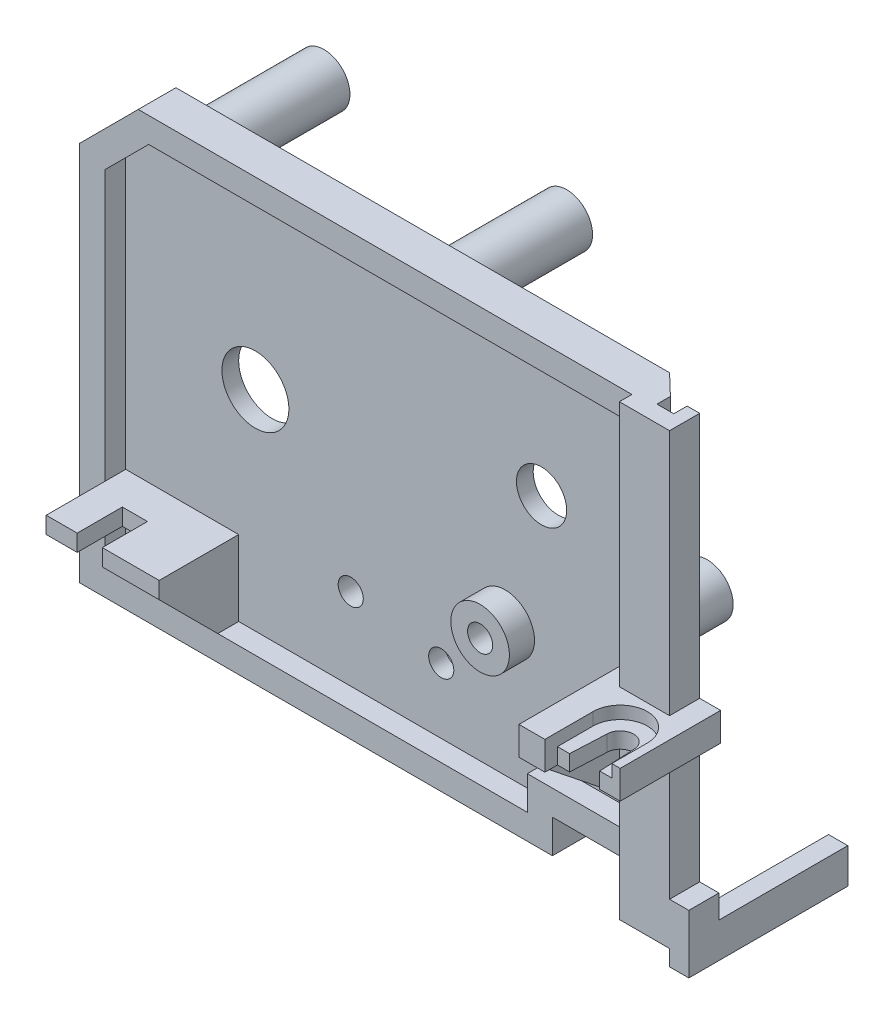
ISO-10303-21;
HEADER;
FILE_DESCRIPTION(('STEP AP214'),'2;1');
FILE_NAME('part.step','',(''),(''),'','','');
FILE_SCHEMA(('AUTOMOTIVE_DESIGN { 1 0 10303 214 1 1 1 1 }'));
ENDSEC;
DATA;
#1=APPLICATION_CONTEXT('core data for automotive mechanical design processes');
#2=APPLICATION_PROTOCOL_DEFINITION('international standard','automotive_design',2000,#1);
#3=PRODUCT_CONTEXT('',#1,'mechanical');
#4=PRODUCT('Part','Part','',(#3));
#5=PRODUCT_RELATED_PRODUCT_CATEGORY('part','',(#4));
#6=PRODUCT_DEFINITION_FORMATION('','',#4);
#7=PRODUCT_DEFINITION_CONTEXT('part definition',#1,'design');
#8=PRODUCT_DEFINITION('design','',#6,#7);
#9=PRODUCT_DEFINITION_SHAPE('','',#8);
#10=(LENGTH_UNIT() NAMED_UNIT(*) SI_UNIT(.MILLI.,.METRE.));
#11=(NAMED_UNIT(*) PLANE_ANGLE_UNIT() SI_UNIT($,.RADIAN.));
#12=(NAMED_UNIT(*) SI_UNIT($,.STERADIAN.) SOLID_ANGLE_UNIT());
#13=UNCERTAINTY_MEASURE_WITH_UNIT(LENGTH_MEASURE(1.E-05),#10,'distance_accuracy_value','');
#14=(GEOMETRIC_REPRESENTATION_CONTEXT(3) GLOBAL_UNCERTAINTY_ASSIGNED_CONTEXT((#13)) GLOBAL_UNIT_ASSIGNED_CONTEXT((#10,
#11,#12)) REPRESENTATION_CONTEXT('',''));
#15=CARTESIAN_POINT('',(0.,0.,0.));
#16=DIRECTION('',(0.,0.,1.));
#17=DIRECTION('',(1.,0.,0.));
#18=AXIS2_PLACEMENT_3D('',#15,#16,#17);
#19=CARTESIAN_POINT('',(40.9669425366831,6.0041314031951,14.4));
#20=DIRECTION('',(0.,0.,-1.));
#21=DIRECTION('',(-1.,0.,0.));
#22=AXIS2_PLACEMENT_3D('',#19,#20,#21);
#23=PLANE('',#22);
#24=DIRECTION('',(0.,1.,0.));
#25=VECTOR('',#24,1.);
#26=CARTESIAN_POINT('',(42.4169425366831,6.0041314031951,14.4));
#27=LINE('',#26,#25);
#28=CARTESIAN_POINT('',(42.4169425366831,4.1041314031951,14.4));
#29=VERTEX_POINT('',#28);
#30=CARTESIAN_POINT('',(42.4169425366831,6.0041314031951,14.4));
#31=VERTEX_POINT('',#30);
#32=EDGE_CURVE('E538',#29,#31,#27,.T.);
#33=ORIENTED_EDGE('',*,*,#32,.T.);
#34=DIRECTION('',(1.,0.,0.));
#35=VECTOR('',#34,1.);
#36=CARTESIAN_POINT('',(44.2169425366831,6.0041314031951,14.4));
#37=LINE('',#36,#35);
#38=CARTESIAN_POINT('',(40.9669425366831,6.0041314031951,14.4));
#39=VERTEX_POINT('',#38);
#40=EDGE_CURVE('E581',#39,#31,#37,.T.);
#41=ORIENTED_EDGE('',*,*,#40,.F.);
#42=DIRECTION('',(0.,1.,0.));
#43=VECTOR('',#42,1.);
#44=CARTESIAN_POINT('',(40.9669425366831,7.5041314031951,14.4));
#45=LINE('',#44,#43);
#46=CARTESIAN_POINT('',(40.9669425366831,4.1041314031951,14.4));
#47=VERTEX_POINT('',#46);
#48=EDGE_CURVE('E503',#39,#47,#45,.F.);
#49=ORIENTED_EDGE('',*,*,#48,.T.);
#50=DIRECTION('',(-1.,0.,0.));
#51=VECTOR('',#50,1.);
#52=CARTESIAN_POINT('',(40.9669425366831,4.1041314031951,14.4));
#53=LINE('',#52,#51);
#54=EDGE_CURVE('E602',#29,#47,#53,.T.);
#55=ORIENTED_EDGE('',*,*,#54,.F.);
#56=EDGE_LOOP('',(#33,#41,#49,#55));
#57=FACE_BOUND('',#56,.T.);
#58=ADVANCED_FACE('F15',(#57),#23,.F.);
#59=CARTESIAN_POINT('',(44.2169425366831,6.0041314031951,11.9717243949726));
#60=DIRECTION('',(0.,1.,0.));
#61=DIRECTION('',(0.,0.,1.));
#62=AXIS2_PLACEMENT_3D('',#59,#60,#61);
#63=PLANE('',#62);
#64=CARTESIAN_POINT('',(44.2169425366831,6.0041314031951,10.15));
#65=DIRECTION('',(0.,1.,0.));
#66=DIRECTION('',(0.,0.,1.));
#67=AXIS2_PLACEMENT_3D('',#64,#65,#66);
#68=CIRCLE('',#67,1.6);
#69=CARTESIAN_POINT('',(42.6169425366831,6.0041314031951,10.15));
#70=VERTEX_POINT('',#69);
#71=CARTESIAN_POINT('',(45.8169425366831,6.0041314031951,10.15));
#72=VERTEX_POINT('',#71);
#73=EDGE_CURVE('E19',#70,#72,#68,.F.);
#74=ORIENTED_EDGE('',*,*,#73,.T.);
#75=DIRECTION('',(-0.047006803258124,0.,-0.998894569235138));
#76=VECTOR('',#75,1.);
#77=CARTESIAN_POINT('',(45.8169425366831,6.0041314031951,10.15));
#78=LINE('',#77,#76);
#79=CARTESIAN_POINT('',(46.0169425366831,6.0041314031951,14.4));
#80=VERTEX_POINT('',#79);
#81=EDGE_CURVE('E549',#72,#80,#78,.F.);
#82=ORIENTED_EDGE('',*,*,#81,.T.);
#83=DIRECTION('',(-1.,0.,0.));
#84=VECTOR('',#83,1.);
#85=CARTESIAN_POINT('',(46.0169425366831,6.0041314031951,14.4));
#86=LINE('',#85,#84);
#87=CARTESIAN_POINT('',(47.4669425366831,6.0041314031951,14.4));
#88=VERTEX_POINT('',#87);
#89=EDGE_CURVE('E550',#80,#88,#86,.F.);
#90=ORIENTED_EDGE('',*,*,#89,.T.);
#91=DIRECTION('',(0.,0.,-1.));
#92=VECTOR('',#91,1.);
#93=CARTESIAN_POINT('',(47.4669425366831,6.0041314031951,15.9));
#94=LINE('',#93,#92);
#95=CARTESIAN_POINT('',(47.4669425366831,6.0041314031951,10.15));
#96=VERTEX_POINT('',#95);
#97=EDGE_CURVE('E489',#88,#96,#94,.T.);
#98=ORIENTED_EDGE('',*,*,#97,.T.);
#99=CARTESIAN_POINT('',(44.2169425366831,6.0041314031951,10.15));
#100=DIRECTION('',(0.,-1.,0.));
#101=DIRECTION('',(0.,0.,-1.));
#102=AXIS2_PLACEMENT_3D('',#99,#100,#101);
#103=CIRCLE('',#102,3.25);
#104=CARTESIAN_POINT('',(40.9669425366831,6.0041314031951,10.15));
#105=VERTEX_POINT('',#104);
#106=EDGE_CURVE('E498',#96,#105,#103,.F.);
#107=ORIENTED_EDGE('',*,*,#106,.T.);
#108=DIRECTION('',(0.,0.,1.));
#109=VECTOR('',#108,1.);
#110=CARTESIAN_POINT('',(40.9669425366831,6.0041314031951,10.15));
#111=LINE('',#110,#109);
#112=EDGE_CURVE('E499',#105,#39,#111,.T.);
#113=ORIENTED_EDGE('',*,*,#112,.T.);
#114=ORIENTED_EDGE('',*,*,#40,.T.);
#115=DIRECTION('',(-0.047006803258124,0.,0.998894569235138));
#116=VECTOR('',#115,1.);
#117=CARTESIAN_POINT('',(42.4169425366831,6.0041314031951,14.4));
#118=LINE('',#117,#116);
#119=EDGE_CURVE('E537',#31,#70,#118,.F.);
#120=ORIENTED_EDGE('',*,*,#119,.T.);
#121=EDGE_LOOP('',(#74,#82,#90,#98,#107,#113,#114,#120));
#122=FACE_BOUND('',#121,.T.);
#123=ADVANCED_FACE('F721',(#122),#63,.T.);
#124=CARTESIAN_POINT('',(45.9669425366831,-14.2958685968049,-13.));
#125=DIRECTION('',(0.,0.,-1.));
#126=DIRECTION('',(-1.,0.,0.));
#127=AXIS2_PLACEMENT_3D('',#124,#125,#126);
#128=PLANE('',#127);
#129=DIRECTION('',(0.,1.,0.));
#130=VECTOR('',#129,1.);
#131=CARTESIAN_POINT('',(45.9669425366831,-15.8250993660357,-13.));
#132=LINE('',#131,#130);
#133=CARTESIAN_POINT('',(45.9669425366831,-18.4958685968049,-13.));
#134=VERTEX_POINT('',#133);
#135=CARTESIAN_POINT('',(45.9669425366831,-14.2958685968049,-13.));
#136=VERTEX_POINT('',#135);
#137=EDGE_CURVE('E1143',#134,#136,#132,.T.);
#138=ORIENTED_EDGE('',*,*,#137,.T.);
#139=DIRECTION('',(1.,0.,0.));
#140=VECTOR('',#139,1.);
#141=CARTESIAN_POINT('',(45.9669425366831,-14.2958685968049,-13.));
#142=LINE('',#141,#140);
#143=CARTESIAN_POINT('',(48.2669425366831,-14.2958685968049,-13.));
#144=VERTEX_POINT('',#143);
#145=EDGE_CURVE('E1138',#144,#136,#142,.F.);
#146=ORIENTED_EDGE('',*,*,#145,.F.);
#147=DIRECTION('',(0.,1.,0.));
#148=VECTOR('',#147,1.);
#149=CARTESIAN_POINT('',(48.2669425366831,-15.8250993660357,-13.));
#150=LINE('',#149,#148);
#151=CARTESIAN_POINT('',(48.2669425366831,-18.4958685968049,-13.));
#152=VERTEX_POINT('',#151);
#153=EDGE_CURVE('E1335',#152,#144,#150,.T.);
#154=ORIENTED_EDGE('',*,*,#153,.F.);
#155=DIRECTION('',(1.,0.,0.));
#156=VECTOR('',#155,1.);
#157=CARTESIAN_POINT('',(45.9669425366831,-18.4958685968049,-13.));
#158=LINE('',#157,#156);
#159=EDGE_CURVE('E536',#134,#152,#158,.T.);
#160=ORIENTED_EDGE('',*,*,#159,.F.);
#161=EDGE_LOOP('',(#138,#146,#154,#160));
#162=FACE_BOUND('',#161,.T.);
#163=ADVANCED_FACE('F1909',(#162),#128,.T.);
#164=CARTESIAN_POINT('',(46.0169425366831,6.0041314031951,14.4));
#165=DIRECTION('',(0.,0.,-1.));
#166=DIRECTION('',(-1.,0.,0.));
#167=AXIS2_PLACEMENT_3D('',#164,#165,#166);
#168=PLANE('',#167);
#169=DIRECTION('',(0.,1.,0.));
#170=VECTOR('',#169,1.);
#171=CARTESIAN_POINT('',(46.0169425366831,6.0041314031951,14.4));
#172=LINE('',#171,#170);
#173=CARTESIAN_POINT('',(46.0169425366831,4.1041314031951,14.4));
#174=VERTEX_POINT('',#173);
#175=EDGE_CURVE('E546',#80,#174,#172,.F.);
#176=ORIENTED_EDGE('',*,*,#175,.T.);
#177=DIRECTION('',(1.,0.,0.));
#178=VECTOR('',#177,1.);
#179=CARTESIAN_POINT('',(37.8669425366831,4.1041314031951,14.4));
#180=LINE('',#179,#178);
#181=CARTESIAN_POINT('',(48.4669425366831,4.1041314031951,14.4));
#182=VERTEX_POINT('',#181);
#183=EDGE_CURVE('E553',#182,#174,#180,.F.);
#184=ORIENTED_EDGE('',*,*,#183,.F.);
#185=DIRECTION('',(0.,1.,0.));
#186=VECTOR('',#185,1.);
#187=CARTESIAN_POINT('',(48.4669425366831,7.5041314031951,14.4));
#188=LINE('',#187,#186);
#189=CARTESIAN_POINT('',(48.4669425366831,7.5041314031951,14.4));
#190=VERTEX_POINT('',#189);
#191=EDGE_CURVE('E492',#190,#182,#188,.F.);
#192=ORIENTED_EDGE('',*,*,#191,.F.);
#193=DIRECTION('',(-1.,0.,0.));
#194=VECTOR('',#193,1.);
#195=CARTESIAN_POINT('',(46.0169425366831,7.5041314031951,14.4));
#196=LINE('',#195,#194);
#197=CARTESIAN_POINT('',(47.4669425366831,7.5041314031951,14.4));
#198=VERTEX_POINT('',#197);
#199=EDGE_CURVE('E579',#198,#190,#196,.F.);
#200=ORIENTED_EDGE('',*,*,#199,.F.);
#201=DIRECTION('',(0.,1.,0.));
#202=VECTOR('',#201,1.);
#203=CARTESIAN_POINT('',(47.4669425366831,7.5041314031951,14.4));
#204=LINE('',#203,#202);
#205=EDGE_CURVE('E488',#198,#88,#204,.F.);
#206=ORIENTED_EDGE('',*,*,#205,.T.);
#207=ORIENTED_EDGE('',*,*,#89,.F.);
#208=EDGE_LOOP('',(#176,#184,#192,#200,#206,#207));
#209=FACE_BOUND('',#208,.T.);
#210=ADVANCED_FACE('F1902',(#209),#168,.F.);
#211=CARTESIAN_POINT('',(45.8169425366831,6.0041314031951,10.15));
#212=DIRECTION('',(0.998894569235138,0.,-0.047006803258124));
#213=DIRECTION('',(-0.047006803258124,0.,-0.998894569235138));
#214=AXIS2_PLACEMENT_3D('',#211,#212,#213);
#215=PLANE('',#214);
#216=DIRECTION('',(0.,1.,0.));
#217=VECTOR('',#216,1.);
#218=CARTESIAN_POINT('',(45.8169425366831,6.0041314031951,10.15));
#219=LINE('',#218,#217);
#220=CARTESIAN_POINT('',(45.8169425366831,4.1041314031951,10.15));
#221=VERTEX_POINT('',#220);
#222=EDGE_CURVE('E541',#72,#221,#219,.F.);
#223=ORIENTED_EDGE('',*,*,#222,.T.);
#224=DIRECTION('',(-0.0470068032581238,0.,-0.998894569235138));
#225=VECTOR('',#224,1.);
#226=CARTESIAN_POINT('',(46.0169425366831,4.1041314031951,14.4));
#227=LINE('',#226,#225);
#228=EDGE_CURVE('E555',#174,#221,#227,.T.);
#229=ORIENTED_EDGE('',*,*,#228,.F.);
#230=ORIENTED_EDGE('',*,*,#175,.F.);
#231=ORIENTED_EDGE('',*,*,#81,.F.);
#232=EDGE_LOOP('',(#223,#229,#230,#231));
#233=FACE_BOUND('',#232,.T.);
#234=ADVANCED_FACE('F1377',(#233),#215,.F.);
#235=CARTESIAN_POINT('',(44.2169425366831,6.0041314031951,10.15));
#236=DIRECTION('',(0.,1.,0.));
#237=DIRECTION('',(0.,0.,1.));
#238=AXIS2_PLACEMENT_3D('',#235,#236,#237);
#239=CYLINDRICAL_SURFACE('',#238,1.6);
#240=ORIENTED_EDGE('',*,*,#222,.F.);
#241=ORIENTED_EDGE('',*,*,#73,.F.);
#242=DIRECTION('',(0.,1.,0.));
#243=VECTOR('',#242,1.);
#244=CARTESIAN_POINT('',(42.6169425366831,6.0041314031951,10.15));
#245=LINE('',#244,#243);
#246=CARTESIAN_POINT('',(42.6169425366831,4.1041314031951,10.15));
#247=VERTEX_POINT('',#246);
#248=EDGE_CURVE('E534',#70,#247,#245,.F.);
#249=ORIENTED_EDGE('',*,*,#248,.T.);
#250=CARTESIAN_POINT('',(44.2169425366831,4.1041314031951,10.15));
#251=DIRECTION('',(0.,1.,0.));
#252=DIRECTION('',(0.,0.,1.));
#253=AXIS2_PLACEMENT_3D('',#250,#251,#252);
#254=CIRCLE('',#253,1.6);
#255=EDGE_CURVE('E718',#221,#247,#254,.T.);
#256=ORIENTED_EDGE('',*,*,#255,.F.);
#257=EDGE_LOOP('',(#240,#241,#249,#256));
#258=FACE_BOUND('',#257,.T.);
#259=ADVANCED_FACE('F1378',(#258),#239,.F.);
#260=CARTESIAN_POINT('',(42.4169425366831,6.0041314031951,14.4));
#261=DIRECTION('',(-0.998894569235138,0.,-0.047006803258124));
#262=DIRECTION('',(-0.047006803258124,0.,0.998894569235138));
#263=AXIS2_PLACEMENT_3D('',#260,#261,#262);
#264=PLANE('',#263);
#265=ORIENTED_EDGE('',*,*,#248,.F.);
#266=ORIENTED_EDGE('',*,*,#119,.F.);
#267=ORIENTED_EDGE('',*,*,#32,.F.);
#268=DIRECTION('',(-0.0470068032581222,0.,0.998894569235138));
#269=VECTOR('',#268,1.);
#270=CARTESIAN_POINT('',(42.6169425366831,4.1041314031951,10.15));
#271=LINE('',#270,#269);
#272=EDGE_CURVE('E613',#247,#29,#271,.T.);
#273=ORIENTED_EDGE('',*,*,#272,.F.);
#274=EDGE_LOOP('',(#265,#266,#267,#273));
#275=FACE_BOUND('',#274,.T.);
#276=ADVANCED_FACE('F1383',(#275),#264,.F.);
#277=CARTESIAN_POINT('',(45.9669425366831,-18.4958685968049,-13.));
#278=DIRECTION('',(0.,-1.,0.));
#279=DIRECTION('',(0.,0.,-1.));
#280=AXIS2_PLACEMENT_3D('',#277,#278,#279);
#281=PLANE('',#280);
#282=DIRECTION('',(0.,0.,-1.));
#283=VECTOR('',#282,1.);
#284=CARTESIAN_POINT('',(45.9669425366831,-18.4958685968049,-2.67076923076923));
#285=LINE('',#284,#283);
#286=CARTESIAN_POINT('',(45.9669425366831,-18.4958685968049,6.));
#287=VERTEX_POINT('',#286);
#288=EDGE_CURVE('E565',#287,#134,#285,.T.);
#289=ORIENTED_EDGE('',*,*,#288,.T.);
#290=ORIENTED_EDGE('',*,*,#159,.T.);
#291=DIRECTION('',(0.,0.,-1.));
#292=VECTOR('',#291,1.);
#293=CARTESIAN_POINT('',(48.2669425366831,-18.4958685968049,-2.67076923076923));
#294=LINE('',#293,#292);
#295=CARTESIAN_POINT('',(48.2669425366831,-18.4958685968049,6.));
#296=VERTEX_POINT('',#295);
#297=EDGE_CURVE('E1122',#296,#152,#294,.T.);
#298=ORIENTED_EDGE('',*,*,#297,.F.);
#299=DIRECTION('',(1.,0.,0.));
#300=VECTOR('',#299,1.);
#301=CARTESIAN_POINT('',(39.9669425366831,-18.4958685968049,6.));
#302=LINE('',#301,#300);
#303=EDGE_CURVE('E1074',#287,#296,#302,.T.);
#304=ORIENTED_EDGE('',*,*,#303,.F.);
#305=EDGE_LOOP('',(#289,#290,#298,#304));
#306=FACE_BOUND('',#305,.T.);
#307=ADVANCED_FACE('F1333',(#306),#281,.T.);
#308=CARTESIAN_POINT('',(-11.5330574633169,23.6224034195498,4.45677165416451));
#309=DIRECTION('',(1.,0.,0.));
#310=DIRECTION('',(0.,0.,-1.));
#311=AXIS2_PLACEMENT_3D('',#308,#309,#310);
#312=PLANE('',#311);
#313=DIRECTION('',(0.,-0.707106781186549,-0.707106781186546));
#314=VECTOR('',#313,1.);
#315=CARTESIAN_POINT('',(-11.5330574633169,-12.4958685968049,4.5));
#316=LINE('',#315,#314);
#317=CARTESIAN_POINT('',(-11.5330574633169,-5.4958685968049,11.5));
#318=VERTEX_POINT('',#317);
#319=CARTESIAN_POINT('',(-11.5330574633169,-12.4958685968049,4.5));
#320=VERTEX_POINT('',#319);
#321=EDGE_CURVE('E1078',#318,#320,#316,.T.);
#322=ORIENTED_EDGE('',*,*,#321,.F.);
#323=DIRECTION('',(0.,0.,-1.));
#324=VECTOR('',#323,1.);
#325=CARTESIAN_POINT('',(-11.5330574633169,-5.4958685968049,2.));
#326=LINE('',#325,#324);
#327=CARTESIAN_POINT('',(-11.5330574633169,-5.4958685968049,2.));
#328=VERTEX_POINT('',#327);
#329=EDGE_CURVE('E1114',#328,#318,#326,.F.);
#330=ORIENTED_EDGE('',*,*,#329,.F.);
#331=DIRECTION('',(0.,1.,0.));
#332=VECTOR('',#331,1.);
#333=CARTESIAN_POINT('',(-11.5330574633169,10.6286516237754,2.));
#334=LINE('',#333,#332);
#335=CARTESIAN_POINT('',(-11.5330574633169,-12.4958685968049,2.));
#336=VERTEX_POINT('',#335);
#337=EDGE_CURVE('E152',#336,#328,#334,.T.);
#338=ORIENTED_EDGE('',*,*,#337,.F.);
#339=DIRECTION('',(0.,0.,-1.));
#340=VECTOR('',#339,1.);
#341=CARTESIAN_POINT('',(-11.5330574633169,-12.4958685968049,4.5));
#342=LINE('',#341,#340);
#343=EDGE_CURVE('E1084',#336,#320,#342,.F.);
#344=ORIENTED_EDGE('',*,*,#343,.T.);
#345=EDGE_LOOP('',(#322,#330,#338,#344));
#346=FACE_BOUND('',#345,.T.);
#347=ADVANCED_FACE('F1870',(#346),#312,.F.);
#348=CARTESIAN_POINT('',(8.70975865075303,10.6286516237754,2.));
#349=DIRECTION('',(0.,0.,1.));
#350=DIRECTION('',(1.,0.,0.));
#351=AXIS2_PLACEMENT_3D('',#348,#349,#350);
#352=PLANE('',#351);
#353=DIRECTION('',(0.,1.,0.));
#354=VECTOR('',#353,1.);
#355=CARTESIAN_POINT('',(-23.0330574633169,28.7614907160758,2.));
#356=LINE('',#355,#354);
#357=CARTESIAN_POINT('',(-23.0330574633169,-5.4958685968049,2.));
#358=VERTEX_POINT('',#357);
#359=CARTESIAN_POINT('',(-23.0330574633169,-12.4958685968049,2.));
#360=VERTEX_POINT('',#359);
#361=EDGE_CURVE('E1087',#358,#360,#356,.F.);
#362=ORIENTED_EDGE('',*,*,#361,.T.);
#363=DIRECTION('',(1.,0.,0.));
#364=VECTOR('',#363,1.);
#365=CARTESIAN_POINT('',(-23.0330574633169,-12.4958685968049,2.));
#366=LINE('',#365,#364);
#367=EDGE_CURVE('E1080',#360,#336,#366,.T.);
#368=ORIENTED_EDGE('',*,*,#367,.T.);
#369=ORIENTED_EDGE('',*,*,#337,.T.);
#370=DIRECTION('',(1.,0.,0.));
#371=VECTOR('',#370,1.);
#372=CARTESIAN_POINT('',(-9.53305746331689,-5.4958685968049,2.));
#373=LINE('',#372,#371);
#374=EDGE_CURVE('E1932',#358,#328,#373,.T.);
#375=ORIENTED_EDGE('',*,*,#374,.F.);
#376=EDGE_LOOP('',(#362,#368,#369,#375));
#377=FACE_BOUND('',#376,.T.);
#378=ADVANCED_FACE('F1862',(#377),#352,.T.);
#379=CARTESIAN_POINT('',(-9.53305746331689,-5.4958685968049,2.));
#380=DIRECTION('',(0.,-1.,0.));
#381=DIRECTION('',(0.,0.,-1.));
#382=AXIS2_PLACEMENT_3D('',#379,#380,#381);
#383=PLANE('',#382);
#384=ORIENTED_EDGE('',*,*,#329,.T.);
#385=DIRECTION('',(1.,0.,0.));
#386=VECTOR('',#385,1.);
#387=CARTESIAN_POINT('',(-16.2830574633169,-5.4958685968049,11.5));
#388=LINE('',#387,#386);
#389=CARTESIAN_POINT('',(-16.3330574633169,-5.4958685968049,11.5));
#390=VERTEX_POINT('',#389);
#391=EDGE_CURVE('E1361',#390,#318,#388,.T.);
#392=ORIENTED_EDGE('',*,*,#391,.F.);
#393=DIRECTION('',(0.,0.,-1.));
#394=VECTOR('',#393,1.);
#395=CARTESIAN_POINT('',(-16.3330574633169,-5.4958685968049,6.1));
#396=LINE('',#395,#394);
#397=CARTESIAN_POINT('',(-16.3330574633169,-5.4958685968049,6.1));
#398=VERTEX_POINT('',#397);
#399=EDGE_CURVE('E1340',#390,#398,#396,.T.);
#400=ORIENTED_EDGE('',*,*,#399,.T.);
#401=DIRECTION('',(-1.,0.,0.));
#402=VECTOR('',#401,1.);
#403=CARTESIAN_POINT('',(-19.3330574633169,-5.4958685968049,6.1));
#404=LINE('',#403,#402);
#405=CARTESIAN_POINT('',(-19.3330574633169,-5.4958685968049,6.1));
#406=VERTEX_POINT('',#405);
#407=EDGE_CURVE('E1356',#398,#406,#404,.T.);
#408=ORIENTED_EDGE('',*,*,#407,.T.);
#409=DIRECTION('',(0.,0.,1.));
#410=VECTOR('',#409,1.);
#411=CARTESIAN_POINT('',(-19.3330574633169,-5.4958685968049,11.5));
#412=LINE('',#411,#410);
#413=CARTESIAN_POINT('',(-19.3330574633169,-5.4958685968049,11.5));
#414=VERTEX_POINT('',#413);
#415=EDGE_CURVE('E1345',#406,#414,#412,.T.);
#416=ORIENTED_EDGE('',*,*,#415,.T.);
#417=DIRECTION('',(1.,0.,0.));
#418=VECTOR('',#417,1.);
#419=CARTESIAN_POINT('',(-16.2830574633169,-5.4958685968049,11.5));
#420=LINE('',#419,#418);
#421=CARTESIAN_POINT('',(-23.0330574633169,-5.4958685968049,11.5));
#422=VERTEX_POINT('',#421);
#423=EDGE_CURVE('E1343',#422,#414,#420,.T.);
#424=ORIENTED_EDGE('',*,*,#423,.F.);
#425=DIRECTION('',(0.,0.,1.));
#426=VECTOR('',#425,1.);
#427=CARTESIAN_POINT('',(-23.0330574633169,-5.4958685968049,2.));
#428=LINE('',#427,#426);
#429=CARTESIAN_POINT('',(-23.0330574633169,-5.4958685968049,4.5));
#430=VERTEX_POINT('',#429);
#431=EDGE_CURVE('E946',#430,#422,#428,.T.);
#432=ORIENTED_EDGE('',*,*,#431,.F.);
#433=DIRECTION('',(0.,0.,1.));
#434=VECTOR('',#433,1.);
#435=CARTESIAN_POINT('',(-23.0330574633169,-5.4958685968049,4.5));
#436=LINE('',#435,#434);
#437=EDGE_CURVE('E1089',#430,#358,#436,.F.);
#438=ORIENTED_EDGE('',*,*,#437,.T.);
#439=ORIENTED_EDGE('',*,*,#374,.T.);
#440=EDGE_LOOP('',(#384,#392,#400,#408,#416,#424,#432,#438,#439));
#441=FACE_BOUND('',#440,.T.);
#442=ADVANCED_FACE('F1855',(#441),#383,.T.);
#443=CARTESIAN_POINT('',(45.9669425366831,37.0041314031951,6.));
#444=DIRECTION('',(1.,0.,0.));
#445=DIRECTION('',(0.,0.,-1.));
#446=AXIS2_PLACEMENT_3D('',#443,#444,#445);
#447=PLANE('',#446);
#448=DIRECTION('',(0.,0.,1.));
#449=VECTOR('',#448,1.);
#450=CARTESIAN_POINT('',(45.9669425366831,-11.4958685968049,6.));
#451=LINE('',#450,#449);
#452=CARTESIAN_POINT('',(45.9669425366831,-11.4958685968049,2.4));
#453=VERTEX_POINT('',#452);
#454=CARTESIAN_POINT('',(45.9669425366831,-11.4958685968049,6.));
#455=VERTEX_POINT('',#454);
#456=EDGE_CURVE('E1109',#453,#455,#451,.T.);
#457=ORIENTED_EDGE('',*,*,#456,.F.);
#458=DIRECTION('',(0.,1.,0.));
#459=VECTOR('',#458,1.);
#460=CARTESIAN_POINT('',(45.9669425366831,37.0041314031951,2.4));
#461=LINE('',#460,#459);
#462=CARTESIAN_POINT('',(45.9669425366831,4.1041314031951,2.4));
#463=VERTEX_POINT('',#462);
#464=EDGE_CURVE('E576',#463,#453,#461,.F.);
#465=ORIENTED_EDGE('',*,*,#464,.F.);
#466=DIRECTION('',(0.,0.,-1.));
#467=VECTOR('',#466,1.);
#468=CARTESIAN_POINT('',(45.9669425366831,4.1041314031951,6.));
#469=LINE('',#468,#467);
#470=CARTESIAN_POINT('',(45.9669425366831,4.1041314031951,6.));
#471=VERTEX_POINT('',#470);
#472=EDGE_CURVE('E561',#471,#463,#469,.T.);
#473=ORIENTED_EDGE('',*,*,#472,.F.);
#474=DIRECTION('',(0.,1.,0.));
#475=VECTOR('',#474,1.);
#476=CARTESIAN_POINT('',(45.9669425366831,37.0041314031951,6.));
#477=LINE('',#476,#475);
#478=EDGE_CURVE('E1070',#455,#471,#477,.T.);
#479=ORIENTED_EDGE('',*,*,#478,.F.);
#480=EDGE_LOOP('',(#457,#465,#473,#479));
#481=FACE_BOUND('',#480,.T.);
#482=ADVANCED_FACE('F1110',(#481),#447,.T.);
#483=CARTESIAN_POINT('',(45.9669425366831,-11.4958685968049,6.));
#484=DIRECTION('',(0.,1.,0.));
#485=DIRECTION('',(0.,0.,1.));
#486=AXIS2_PLACEMENT_3D('',#483,#484,#485);
#487=PLANE('',#486);
#488=ORIENTED_EDGE('',*,*,#456,.T.);
#489=DIRECTION('',(1.,0.,0.));
#490=VECTOR('',#489,1.);
#491=CARTESIAN_POINT('',(39.9669425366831,-11.4958685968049,6.));
#492=LINE('',#491,#490);
#493=CARTESIAN_POINT('',(48.2669425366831,-11.4958685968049,6.));
#494=VERTEX_POINT('',#493);
#495=EDGE_CURVE('E1118',#494,#455,#492,.F.);
#496=ORIENTED_EDGE('',*,*,#495,.F.);
#497=DIRECTION('',(0.,0.,-1.));
#498=VECTOR('',#497,1.);
#499=CARTESIAN_POINT('',(48.2669425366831,-11.4958685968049,-2.67076923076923));
#500=LINE('',#499,#498);
#501=CARTESIAN_POINT('',(48.2669425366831,-11.4958685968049,2.4));
#502=VERTEX_POINT('',#501);
#503=EDGE_CURVE('E1113',#502,#494,#500,.F.);
#504=ORIENTED_EDGE('',*,*,#503,.F.);
#505=DIRECTION('',(-1.,0.,0.));
#506=VECTOR('',#505,1.);
#507=CARTESIAN_POINT('',(45.9669425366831,-11.4958685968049,2.4));
#508=LINE('',#507,#506);
#509=EDGE_CURVE('E1102',#453,#502,#508,.F.);
#510=ORIENTED_EDGE('',*,*,#509,.F.);
#511=EDGE_LOOP('',(#488,#496,#504,#510));
#512=FACE_BOUND('',#511,.T.);
#513=ADVANCED_FACE('F1116',(#512),#487,.T.);
#514=CARTESIAN_POINT('',(48.2669425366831,-15.8250993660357,-2.67076923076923));
#515=DIRECTION('',(1.,0.,0.));
#516=DIRECTION('',(0.,0.,-1.));
#517=AXIS2_PLACEMENT_3D('',#514,#515,#516);
#518=PLANE('',#517);
#519=ORIENTED_EDGE('',*,*,#297,.T.);
#520=ORIENTED_EDGE('',*,*,#153,.T.);
#521=DIRECTION('',(0.,0.,1.));
#522=VECTOR('',#521,1.);
#523=CARTESIAN_POINT('',(48.2669425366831,-14.2958685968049,2.4));
#524=LINE('',#523,#522);
#525=CARTESIAN_POINT('',(48.2669425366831,-14.2958685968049,2.4));
#526=VERTEX_POINT('',#525);
#527=EDGE_CURVE('E1128',#526,#144,#524,.F.);
#528=ORIENTED_EDGE('',*,*,#527,.F.);
#529=DIRECTION('',(0.,1.,0.));
#530=VECTOR('',#529,1.);
#531=CARTESIAN_POINT('',(48.2669425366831,37.0041314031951,2.4));
#532=LINE('',#531,#530);
#533=EDGE_CURVE('E1101',#502,#526,#532,.F.);
#534=ORIENTED_EDGE('',*,*,#533,.F.);
#535=ORIENTED_EDGE('',*,*,#503,.T.);
#536=DIRECTION('',(0.,1.,0.));
#537=VECTOR('',#536,1.);
#538=CARTESIAN_POINT('',(48.2669425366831,37.0041314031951,6.));
#539=LINE('',#538,#537);
#540=EDGE_CURVE('E1328',#296,#494,#539,.T.);
#541=ORIENTED_EDGE('',*,*,#540,.F.);
#542=EDGE_LOOP('',(#519,#520,#528,#534,#535,#541));
#543=FACE_BOUND('',#542,.T.);
#544=ADVANCED_FACE('F1126',(#543),#518,.T.);
#545=CARTESIAN_POINT('',(45.9669425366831,-14.2958685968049,2.4));
#546=DIRECTION('',(0.,1.,0.));
#547=DIRECTION('',(0.,0.,1.));
#548=AXIS2_PLACEMENT_3D('',#545,#546,#547);
#549=PLANE('',#548);
#550=DIRECTION('',(0.,0.,-1.));
#551=VECTOR('',#550,1.);
#552=CARTESIAN_POINT('',(45.9669425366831,-14.2958685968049,-2.67076923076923));
#553=LINE('',#552,#551);
#554=CARTESIAN_POINT('',(45.9669425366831,-14.2958685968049,2.4));
#555=VERTEX_POINT('',#554);
#556=EDGE_CURVE('E1135',#136,#555,#553,.F.);
#557=ORIENTED_EDGE('',*,*,#556,.T.);
#558=DIRECTION('',(-1.,0.,0.));
#559=VECTOR('',#558,1.);
#560=CARTESIAN_POINT('',(45.9669425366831,-14.2958685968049,2.4));
#561=LINE('',#560,#559);
#562=EDGE_CURVE('E1099',#526,#555,#561,.T.);
#563=ORIENTED_EDGE('',*,*,#562,.F.);
#564=ORIENTED_EDGE('',*,*,#527,.T.);
#565=ORIENTED_EDGE('',*,*,#145,.T.);
#566=EDGE_LOOP('',(#557,#563,#564,#565));
#567=FACE_BOUND('',#566,.T.);
#568=ADVANCED_FACE('F1136',(#567),#549,.T.);
#569=CARTESIAN_POINT('',(-16.3330574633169,-5.4958685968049,6.1));
#570=DIRECTION('',(1.,0.,0.));
#571=DIRECTION('',(0.,0.,-1.));
#572=AXIS2_PLACEMENT_3D('',#569,#570,#571);
#573=PLANE('',#572);
#574=DIRECTION('',(0.,1.,0.));
#575=VECTOR('',#574,1.);
#576=CARTESIAN_POINT('',(-16.3330574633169,-5.4958685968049,6.1));
#577=LINE('',#576,#575);
#578=CARTESIAN_POINT('',(-16.3330574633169,-3.4958685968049,6.1));
#579=VERTEX_POINT('',#578);
#580=EDGE_CURVE('E1349',#579,#398,#577,.F.);
#581=ORIENTED_EDGE('',*,*,#580,.T.);
#582=ORIENTED_EDGE('',*,*,#399,.F.);
#583=DIRECTION('',(0.,1.,0.));
#584=VECTOR('',#583,1.);
#585=CARTESIAN_POINT('',(-16.3330574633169,-4.4958685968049,11.5));
#586=LINE('',#585,#584);
#587=CARTESIAN_POINT('',(-16.3330574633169,-3.4958685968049,11.5));
#588=VERTEX_POINT('',#587);
#589=EDGE_CURVE('E1355',#588,#390,#586,.F.);
#590=ORIENTED_EDGE('',*,*,#589,.F.);
#591=DIRECTION('',(0.,0.,1.));
#592=VECTOR('',#591,1.);
#593=CARTESIAN_POINT('',(-16.3330574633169,-3.4958685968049,2.));
#594=LINE('',#593,#592);
#595=EDGE_CURVE('E961',#579,#588,#594,.T.);
#596=ORIENTED_EDGE('',*,*,#595,.F.);
#597=EDGE_LOOP('',(#581,#582,#590,#596));
#598=FACE_BOUND('',#597,.T.);
#599=ADVANCED_FACE('F1822',(#598),#573,.F.);
#600=CARTESIAN_POINT('',(-16.2830574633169,-4.4958685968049,11.5));
#601=DIRECTION('',(0.,0.,1.));
#602=DIRECTION('',(1.,0.,0.));
#603=AXIS2_PLACEMENT_3D('',#600,#601,#602);
#604=PLANE('',#603);
#605=DIRECTION('',(0.,1.,0.));
#606=VECTOR('',#605,1.);
#607=CARTESIAN_POINT('',(-23.0330574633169,-5.4958685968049,11.5));
#608=LINE('',#607,#606);
#609=CARTESIAN_POINT('',(-23.0330574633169,-3.4958685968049,11.5));
#610=VERTEX_POINT('',#609);
#611=EDGE_CURVE('E944',#422,#610,#608,.T.);
#612=ORIENTED_EDGE('',*,*,#611,.F.);
#613=ORIENTED_EDGE('',*,*,#423,.T.);
#614=DIRECTION('',(0.,1.,0.));
#615=VECTOR('',#614,1.);
#616=CARTESIAN_POINT('',(-19.3330574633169,-5.4958685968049,11.5));
#617=LINE('',#616,#615);
#618=CARTESIAN_POINT('',(-19.3330574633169,-3.4958685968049,11.5));
#619=VERTEX_POINT('',#618);
#620=EDGE_CURVE('E1346',#414,#619,#617,.T.);
#621=ORIENTED_EDGE('',*,*,#620,.T.);
#622=DIRECTION('',(1.,0.,0.));
#623=VECTOR('',#622,1.);
#624=CARTESIAN_POINT('',(-23.0330574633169,-3.4958685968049,11.5));
#625=LINE('',#624,#623);
#626=EDGE_CURVE('E968',#610,#619,#625,.T.);
#627=ORIENTED_EDGE('',*,*,#626,.F.);
#628=EDGE_LOOP('',(#612,#613,#621,#627));
#629=FACE_BOUND('',#628,.T.);
#630=ADVANCED_FACE('F1814',(#629),#604,.T.);
#631=CARTESIAN_POINT('',(-19.3330574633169,-5.4958685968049,11.5));
#632=DIRECTION('',(-1.,0.,0.));
#633=DIRECTION('',(0.,0.,1.));
#634=AXIS2_PLACEMENT_3D('',#631,#632,#633);
#635=PLANE('',#634);
#636=ORIENTED_EDGE('',*,*,#620,.F.);
#637=ORIENTED_EDGE('',*,*,#415,.F.);
#638=DIRECTION('',(0.,1.,0.));
#639=VECTOR('',#638,1.);
#640=CARTESIAN_POINT('',(-19.3330574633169,-5.4958685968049,6.1));
#641=LINE('',#640,#639);
#642=CARTESIAN_POINT('',(-19.3330574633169,-3.4958685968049,6.1));
#643=VERTEX_POINT('',#642);
#644=EDGE_CURVE('E1352',#406,#643,#641,.T.);
#645=ORIENTED_EDGE('',*,*,#644,.T.);
#646=DIRECTION('',(0.,0.,1.));
#647=VECTOR('',#646,1.);
#648=CARTESIAN_POINT('',(-19.3330574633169,-3.4958685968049,2.));
#649=LINE('',#648,#647);
#650=EDGE_CURVE('E966',#619,#643,#649,.F.);
#651=ORIENTED_EDGE('',*,*,#650,.F.);
#652=EDGE_LOOP('',(#636,#637,#645,#651));
#653=FACE_BOUND('',#652,.T.);
#654=ADVANCED_FACE('F1806',(#653),#635,.F.);
#655=CARTESIAN_POINT('',(-19.3330574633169,-5.4958685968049,6.1));
#656=DIRECTION('',(0.,0.,-1.));
#657=DIRECTION('',(-1.,0.,0.));
#658=AXIS2_PLACEMENT_3D('',#655,#656,#657);
#659=PLANE('',#658);
#660=ORIENTED_EDGE('',*,*,#644,.F.);
#661=ORIENTED_EDGE('',*,*,#407,.F.);
#662=ORIENTED_EDGE('',*,*,#580,.F.);
#663=DIRECTION('',(1.,0.,0.));
#664=VECTOR('',#663,1.);
#665=CARTESIAN_POINT('',(-23.0330574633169,-3.4958685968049,6.1));
#666=LINE('',#665,#664);
#667=EDGE_CURVE('E962',#643,#579,#666,.T.);
#668=ORIENTED_EDGE('',*,*,#667,.F.);
#669=EDGE_LOOP('',(#660,#661,#662,#668));
#670=FACE_BOUND('',#669,.T.);
#671=ADVANCED_FACE('F1798',(#670),#659,.F.);
#672=CARTESIAN_POINT('',(-16.2830574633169,-4.4958685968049,11.5));
#673=DIRECTION('',(0.,0.,1.));
#674=DIRECTION('',(1.,0.,0.));
#675=AXIS2_PLACEMENT_3D('',#672,#673,#674);
#676=PLANE('',#675);
#677=DIRECTION('',(0.,1.,0.));
#678=VECTOR('',#677,1.);
#679=CARTESIAN_POINT('',(-9.5330574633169,23.6224034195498,11.5));
#680=LINE('',#679,#678);
#681=CARTESIAN_POINT('',(-9.53305746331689,-3.4958685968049,11.5));
#682=VERTEX_POINT('',#681);
#683=CARTESIAN_POINT('',(-9.53305746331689,-5.4958685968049,11.5));
#684=VERTEX_POINT('',#683);
#685=EDGE_CURVE('E981',#682,#684,#680,.F.);
#686=ORIENTED_EDGE('',*,*,#685,.F.);
#687=DIRECTION('',(1.,0.,0.));
#688=VECTOR('',#687,1.);
#689=CARTESIAN_POINT('',(-23.0330574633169,-3.4958685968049,11.5));
#690=LINE('',#689,#688);
#691=EDGE_CURVE('E975',#588,#682,#690,.T.);
#692=ORIENTED_EDGE('',*,*,#691,.F.);
#693=ORIENTED_EDGE('',*,*,#589,.T.);
#694=ORIENTED_EDGE('',*,*,#391,.T.);
#695=DIRECTION('',(1.,0.,0.));
#696=VECTOR('',#695,1.);
#697=CARTESIAN_POINT('',(-9.53305746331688,-5.49586859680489,11.5));
#698=LINE('',#697,#696);
#699=EDGE_CURVE('E1081',#684,#318,#698,.F.);
#700=ORIENTED_EDGE('',*,*,#699,.F.);
#701=EDGE_LOOP('',(#686,#692,#693,#694,#700));
#702=FACE_BOUND('',#701,.T.);
#703=ADVANCED_FACE('F1791',(#702),#676,.T.);
#704=CARTESIAN_POINT('',(37.8669425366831,4.1041314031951,15.9));
#705=DIRECTION('',(0.,-0.781416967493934,0.624009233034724));
#706=DIRECTION('',(0.,-0.624009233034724,-0.781416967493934));
#707=AXIS2_PLACEMENT_3D('',#704,#705,#706);
#708=PLANE('',#707);
#709=DIRECTION('',(1.,0.,0.));
#710=VECTOR('',#709,1.);
#711=CARTESIAN_POINT('',(37.8669425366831,-6.9958685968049,2.));
#712=LINE('',#711,#710);
#713=CARTESIAN_POINT('',(37.8669425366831,-6.9958685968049,2.));
#714=VERTEX_POINT('',#713);
#715=CARTESIAN_POINT('',(38.8669425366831,-6.9958685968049,2.));
#716=VERTEX_POINT('',#715);
#717=EDGE_CURVE('E527',#714,#716,#712,.T.);
#718=ORIENTED_EDGE('',*,*,#717,.T.);
#719=DIRECTION('',(0.,-0.624009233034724,-0.781416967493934));
#720=VECTOR('',#719,1.);
#721=CARTESIAN_POINT('',(38.8669425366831,4.1041314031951,15.9));
#722=LINE('',#721,#720);
#723=CARTESIAN_POINT('',(38.8669425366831,4.1041314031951,15.9));
#724=VERTEX_POINT('',#723);
#725=EDGE_CURVE('E522',#724,#716,#722,.T.);
#726=ORIENTED_EDGE('',*,*,#725,.F.);
#727=DIRECTION('',(1.,0.,0.));
#728=VECTOR('',#727,1.);
#729=CARTESIAN_POINT('',(43.1669425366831,4.1041314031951,15.9));
#730=LINE('',#729,#728);
#731=CARTESIAN_POINT('',(37.8669425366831,4.1041314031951,15.9));
#732=VERTEX_POINT('',#731);
#733=EDGE_CURVE('E525',#732,#724,#730,.T.);
#734=ORIENTED_EDGE('',*,*,#733,.F.);
#735=DIRECTION('',(0.,-0.624009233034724,-0.781416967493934));
#736=VECTOR('',#735,1.);
#737=CARTESIAN_POINT('',(37.8669425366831,4.1041314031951,15.9));
#738=LINE('',#737,#736);
#739=EDGE_CURVE('E509',#732,#714,#738,.T.);
#740=ORIENTED_EDGE('',*,*,#739,.T.);
#741=EDGE_LOOP('',(#718,#726,#734,#740));
#742=FACE_BOUND('',#741,.T.);
#743=ADVANCED_FACE('F1400',(#742),#708,.T.);
#744=CARTESIAN_POINT('',(43.1669425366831,5.8041314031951,15.9));
#745=DIRECTION('',(0.,0.,1.));
#746=DIRECTION('',(1.,0.,0.));
#747=AXIS2_PLACEMENT_3D('',#744,#745,#746);
#748=PLANE('',#747);
#749=DIRECTION('',(0.,1.,0.));
#750=VECTOR('',#749,1.);
#751=CARTESIAN_POINT('',(37.8669425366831,27.2810251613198,15.9));
#752=LINE('',#751,#750);
#753=CARTESIAN_POINT('',(37.8669425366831,7.5041314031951,15.9));
#754=VERTEX_POINT('',#753);
#755=EDGE_CURVE('E519',#754,#732,#752,.F.);
#756=ORIENTED_EDGE('',*,*,#755,.T.);
#757=ORIENTED_EDGE('',*,*,#733,.T.);
#758=DIRECTION('',(1.,0.,0.));
#759=VECTOR('',#758,1.);
#760=CARTESIAN_POINT('',(37.8669425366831,4.1041314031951,15.9));
#761=LINE('',#760,#759);
#762=CARTESIAN_POINT('',(40.9669425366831,4.1041314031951,15.9));
#763=VERTEX_POINT('',#762);
#764=EDGE_CURVE('E612',#763,#724,#761,.F.);
#765=ORIENTED_EDGE('',*,*,#764,.F.);
#766=DIRECTION('',(0.,1.,0.));
#767=VECTOR('',#766,1.);
#768=CARTESIAN_POINT('',(40.9669425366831,7.5041314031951,15.9));
#769=LINE('',#768,#767);
#770=CARTESIAN_POINT('',(40.9669425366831,7.5041314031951,15.9));
#771=VERTEX_POINT('',#770);
#772=EDGE_CURVE('E500',#763,#771,#769,.T.);
#773=ORIENTED_EDGE('',*,*,#772,.T.);
#774=DIRECTION('',(1.,0.,0.));
#775=VECTOR('',#774,1.);
#776=CARTESIAN_POINT('',(39.9669425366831,7.5041314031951,15.9));
#777=LINE('',#776,#775);
#778=EDGE_CURVE('E506',#754,#771,#777,.T.);
#779=ORIENTED_EDGE('',*,*,#778,.F.);
#780=EDGE_LOOP('',(#756,#757,#765,#773,#779));
#781=FACE_BOUND('',#780,.T.);
#782=ADVANCED_FACE('F1393',(#781),#748,.T.);
#783=CARTESIAN_POINT('',(40.9669425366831,7.5041314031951,10.15));
#784=DIRECTION('',(-1.,0.,0.));
#785=DIRECTION('',(0.,0.,1.));
#786=AXIS2_PLACEMENT_3D('',#783,#784,#785);
#787=PLANE('',#786);
#788=DIRECTION('',(0.,-1.,0.));
#789=VECTOR('',#788,1.);
#790=CARTESIAN_POINT('',(40.9669425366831,7.5041314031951,10.15));
#791=LINE('',#790,#789);
#792=CARTESIAN_POINT('',(40.9669425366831,7.5041314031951,10.15));
#793=VERTEX_POINT('',#792);
#794=EDGE_CURVE('E495',#105,#793,#791,.F.);
#795=ORIENTED_EDGE('',*,*,#794,.T.);
#796=DIRECTION('',(0.,0.,1.));
#797=VECTOR('',#796,1.);
#798=CARTESIAN_POINT('',(40.9669425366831,7.5041314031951,6.));
#799=LINE('',#798,#797);
#800=EDGE_CURVE('E508',#771,#793,#799,.F.);
#801=ORIENTED_EDGE('',*,*,#800,.F.);
#802=ORIENTED_EDGE('',*,*,#772,.F.);
#803=DIRECTION('',(0.,0.,-1.));
#804=VECTOR('',#803,1.);
#805=CARTESIAN_POINT('',(40.9669425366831,4.1041314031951,6.));
#806=LINE('',#805,#804);
#807=EDGE_CURVE('E609',#47,#763,#806,.F.);
#808=ORIENTED_EDGE('',*,*,#807,.F.);
#809=ORIENTED_EDGE('',*,*,#48,.F.);
#810=ORIENTED_EDGE('',*,*,#112,.F.);
#811=EDGE_LOOP('',(#795,#801,#802,#808,#809,#810));
#812=FACE_BOUND('',#811,.T.);
#813=ADVANCED_FACE('F1389',(#812),#787,.F.);
#814=CARTESIAN_POINT('',(44.2169425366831,7.5041314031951,10.15));
#815=DIRECTION('',(0.,-1.,0.));
#816=DIRECTION('',(0.,0.,-1.));
#817=AXIS2_PLACEMENT_3D('',#814,#815,#816);
#818=CYLINDRICAL_SURFACE('',#817,3.25);
#819=DIRECTION('',(0.,1.,0.));
#820=VECTOR('',#819,1.);
#821=CARTESIAN_POINT('',(47.4669425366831,7.5041314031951,10.15));
#822=LINE('',#821,#820);
#823=CARTESIAN_POINT('',(47.4669425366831,7.5041314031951,10.15));
#824=VERTEX_POINT('',#823);
#825=EDGE_CURVE('E485',#96,#824,#822,.T.);
#826=ORIENTED_EDGE('',*,*,#825,.T.);
#827=CARTESIAN_POINT('',(44.2169425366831,7.5041314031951,10.15));
#828=DIRECTION('',(0.,-1.,0.));
#829=DIRECTION('',(0.,0.,-1.));
#830=AXIS2_PLACEMENT_3D('',#827,#828,#829);
#831=CIRCLE('',#830,3.25);
#832=EDGE_CURVE('E716',#793,#824,#831,.T.);
#833=ORIENTED_EDGE('',*,*,#832,.F.);
#834=ORIENTED_EDGE('',*,*,#794,.F.);
#835=ORIENTED_EDGE('',*,*,#106,.F.);
#836=EDGE_LOOP('',(#826,#833,#834,#835));
#837=FACE_BOUND('',#836,.T.);
#838=ADVANCED_FACE('F725',(#837),#818,.F.);
#839=CARTESIAN_POINT('',(47.4669425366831,7.5041314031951,15.9));
#840=DIRECTION('',(1.,0.,0.));
#841=DIRECTION('',(0.,0.,-1.));
#842=AXIS2_PLACEMENT_3D('',#839,#840,#841);
#843=PLANE('',#842);
#844=DIRECTION('',(0.,0.,1.));
#845=VECTOR('',#844,1.);
#846=CARTESIAN_POINT('',(47.4669425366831,7.5041314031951,6.));
#847=LINE('',#846,#845);
#848=EDGE_CURVE('E586',#824,#198,#847,.T.);
#849=ORIENTED_EDGE('',*,*,#848,.F.);
#850=ORIENTED_EDGE('',*,*,#825,.F.);
#851=ORIENTED_EDGE('',*,*,#97,.F.);
#852=ORIENTED_EDGE('',*,*,#205,.F.);
#853=EDGE_LOOP('',(#849,#850,#851,#852));
#854=FACE_BOUND('',#853,.T.);
#855=ADVANCED_FACE('F729',(#854),#843,.F.);
#856=CARTESIAN_POINT('',(48.4669425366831,7.5041314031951,6.));
#857=DIRECTION('',(1.,0.,0.));
#858=DIRECTION('',(0.,0.,-1.));
#859=AXIS2_PLACEMENT_3D('',#856,#857,#858);
#860=PLANE('',#859);
#861=DIRECTION('',(0.,1.,0.));
#862=VECTOR('',#861,1.);
#863=CARTESIAN_POINT('',(48.4669425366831,37.0041314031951,2.4));
#864=LINE('',#863,#862);
#865=CARTESIAN_POINT('',(48.4669425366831,7.5041314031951,2.4));
#866=VERTEX_POINT('',#865);
#867=CARTESIAN_POINT('',(48.4669425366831,4.1041314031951,2.4));
#868=VERTEX_POINT('',#867);
#869=EDGE_CURVE('E568',#866,#868,#864,.F.);
#870=ORIENTED_EDGE('',*,*,#869,.F.);
#871=DIRECTION('',(0.,0.,1.));
#872=VECTOR('',#871,1.);
#873=CARTESIAN_POINT('',(48.4669425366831,7.5041314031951,6.));
#874=LINE('',#873,#872);
#875=EDGE_CURVE('E584',#190,#866,#874,.F.);
#876=ORIENTED_EDGE('',*,*,#875,.F.);
#877=ORIENTED_EDGE('',*,*,#191,.T.);
#878=DIRECTION('',(0.,0.,-1.));
#879=VECTOR('',#878,1.);
#880=CARTESIAN_POINT('',(48.4669425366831,4.1041314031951,6.));
#881=LINE('',#880,#879);
#882=EDGE_CURVE('E556',#868,#182,#881,.F.);
#883=ORIENTED_EDGE('',*,*,#882,.F.);
#884=EDGE_LOOP('',(#870,#876,#877,#883));
#885=FACE_BOUND('',#884,.T.);
#886=ADVANCED_FACE('F1189',(#885),#860,.T.);
#887=CARTESIAN_POINT('',(-14.7330574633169,-9.49586859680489,0.3));
#888=DIRECTION('',(0.,0.,-1.));
#889=DIRECTION('',(-1.,0.,0.));
#890=AXIS2_PLACEMENT_3D('',#887,#888,#889);
#891=CONICAL_SURFACE('',#890,1.2295,1.02974425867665);
#892=CARTESIAN_POINT('',(-14.7330574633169,-9.4958685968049,1.03875813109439));
#893=VERTEX_POINT('',#892);
#894=VERTEX_LOOP('',#893);
#895=FACE_BOUND('',#894,.T.);
#896=CARTESIAN_POINT('',(-14.7330574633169,-9.49586859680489,0.300000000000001));
#897=DIRECTION('',(0.,0.,-1.));
#898=DIRECTION('',(-1.,0.,0.));
#899=AXIS2_PLACEMENT_3D('',#896,#897,#898);
#900=CIRCLE('',#899,1.2295);
#901=CARTESIAN_POINT('',(-15.9625574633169,-9.49586859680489,0.300000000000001));
#902=VERTEX_POINT('',#901);
#903=EDGE_CURVE('E744',#902,#902,#900,.T.);
#904=ORIENTED_EDGE('',*,*,#903,.T.);
#905=EDGE_LOOP('',(#904));
#906=FACE_BOUND('',#905,.T.);
#907=ADVANCED_FACE('F1186',(#895,#906),#891,.F.);
#908=CARTESIAN_POINT('',(-16.0330574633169,32.0041314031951,0.3));
#909=DIRECTION('',(0.,0.,-1.));
#910=DIRECTION('',(0.,1.,0.));
#911=AXIS2_PLACEMENT_3D('',#908,#909,#910);
#912=CONICAL_SURFACE('',#911,1.2295,1.02974425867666);
#913=CARTESIAN_POINT('',(-16.0330574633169,32.0041314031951,1.03875813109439));
#914=VERTEX_POINT('',#913);
#915=VERTEX_LOOP('',#914);
#916=FACE_BOUND('',#915,.T.);
#917=CARTESIAN_POINT('',(-16.0330574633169,32.0041314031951,0.300000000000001));
#918=DIRECTION('',(0.,0.,-1.));
#919=DIRECTION('',(-1.,0.,0.));
#920=AXIS2_PLACEMENT_3D('',#917,#918,#919);
#921=CIRCLE('',#920,1.2295);
#922=CARTESIAN_POINT('',(-17.2625574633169,32.0041314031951,0.300000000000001));
#923=VERTEX_POINT('',#922);
#924=EDGE_CURVE('E749',#923,#923,#921,.T.);
#925=ORIENTED_EDGE('',*,*,#924,.T.);
#926=EDGE_LOOP('',(#925));
#927=FACE_BOUND('',#926,.T.);
#928=ADVANCED_FACE('F1188',(#916,#927),#912,.F.);
#929=CARTESIAN_POINT('',(12.9669425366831,32.0041314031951,0.3));
#930=DIRECTION('',(0.,0.,-1.));
#931=DIRECTION('',(0.,1.,0.));
#932=AXIS2_PLACEMENT_3D('',#929,#930,#931);
#933=CONICAL_SURFACE('',#932,1.2295,1.02974425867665);
#934=CARTESIAN_POINT('',(12.9669425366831,32.0041314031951,1.03875813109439));
#935=VERTEX_POINT('',#934);
#936=VERTEX_LOOP('',#935);
#937=FACE_BOUND('',#936,.T.);
#938=CARTESIAN_POINT('',(12.9669425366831,32.0041314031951,0.300000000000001));
#939=DIRECTION('',(0.,0.,-1.));
#940=DIRECTION('',(-1.,0.,0.));
#941=AXIS2_PLACEMENT_3D('',#938,#939,#940);
#942=CIRCLE('',#941,1.2295);
#943=CARTESIAN_POINT('',(11.7374425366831,32.0041314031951,0.300000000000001));
#944=VERTEX_POINT('',#943);
#945=EDGE_CURVE('E754',#944,#944,#942,.T.);
#946=ORIENTED_EDGE('',*,*,#945,.T.);
#947=EDGE_LOOP('',(#946));
#948=FACE_BOUND('',#947,.T.);
#949=ADVANCED_FACE('F1193',(#937,#948),#933,.F.);
#950=CARTESIAN_POINT('',(29.7669425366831,2.1041314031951,0.3));
#951=DIRECTION('',(0.,0.,-1.));
#952=DIRECTION('',(-1.,0.,0.));
#953=AXIS2_PLACEMENT_3D('',#950,#951,#952);
#954=CONICAL_SURFACE('',#953,1.2295,1.02974425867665);
#955=CARTESIAN_POINT('',(29.7669425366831,2.1041314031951,1.03875813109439));
#956=VERTEX_POINT('',#955);
#957=VERTEX_LOOP('',#956);
#958=FACE_BOUND('',#957,.T.);
#959=CARTESIAN_POINT('',(29.7669425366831,2.1041314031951,0.300000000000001));
#960=DIRECTION('',(0.,0.,-1.));
#961=DIRECTION('',(-1.,0.,0.));
#962=AXIS2_PLACEMENT_3D('',#959,#960,#961);
#963=CIRCLE('',#962,1.2295);
#964=CARTESIAN_POINT('',(28.5374425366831,2.1041314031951,0.300000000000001));
#965=VERTEX_POINT('',#964);
#966=EDGE_CURVE('E759',#965,#965,#963,.T.);
#967=ORIENTED_EDGE('',*,*,#966,.T.);
#968=EDGE_LOOP('',(#967));
#969=FACE_BOUND('',#968,.T.);
#970=ADVANCED_FACE('F1197',(#958,#969),#954,.F.);
#971=CARTESIAN_POINT('',(-28.0330574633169,-1.9958685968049,-5.4));
#972=DIRECTION('',(1.,0.,0.));
#973=DIRECTION('',(0.,0.,-1.));
#974=AXIS2_PLACEMENT_3D('',#971,#972,#973);
#975=PLANE('',#974);
#976=DIRECTION('',(0.,0.,1.));
#977=VECTOR('',#976,1.);
#978=CARTESIAN_POINT('',(-28.0330574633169,2.5041314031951,-12.9));
#979=LINE('',#978,#977);
#980=CARTESIAN_POINT('',(-28.0330574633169,2.5041314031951,-12.9));
#981=VERTEX_POINT('',#980);
#982=CARTESIAN_POINT('',(-28.0330574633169,2.5041314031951,2.1));
#983=VERTEX_POINT('',#982);
#984=EDGE_CURVE('E771',#981,#983,#979,.T.);
#985=ORIENTED_EDGE('',*,*,#984,.F.);
#986=DIRECTION('',(0.,1.,0.));
#987=VECTOR('',#986,1.);
#988=CARTESIAN_POINT('',(-28.0330574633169,-6.4958685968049,-12.9));
#989=LINE('',#988,#987);
#990=CARTESIAN_POINT('',(-28.0330574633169,-6.4958685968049,-12.9));
#991=VERTEX_POINT('',#990);
#992=EDGE_CURVE('E764',#991,#981,#989,.T.);
#993=ORIENTED_EDGE('',*,*,#992,.F.);
#994=DIRECTION('',(0.,0.,-1.));
#995=VECTOR('',#994,1.);
#996=CARTESIAN_POINT('',(-28.0330574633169,-6.4958685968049,2.1));
#997=LINE('',#996,#995);
#998=CARTESIAN_POINT('',(-28.0330574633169,-6.4958685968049,2.1));
#999=VERTEX_POINT('',#998);
#1000=EDGE_CURVE('E768',#999,#991,#997,.T.);
#1001=ORIENTED_EDGE('',*,*,#1000,.F.);
#1002=DIRECTION('',(0.,1.,0.));
#1003=VECTOR('',#1002,1.);
#1004=CARTESIAN_POINT('',(-28.0330574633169,2.5041314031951,2.1));
#1005=LINE('',#1004,#1003);
#1006=EDGE_CURVE('E776',#983,#999,#1005,.F.);
#1007=ORIENTED_EDGE('',*,*,#1006,.F.);
#1008=EDGE_LOOP('',(#985,#993,#1001,#1007));
#1009=FACE_BOUND('',#1008,.T.);
#1010=ADVANCED_FACE('F1201',(#1009),#975,.F.);
#1011=CARTESIAN_POINT('',(45.9669425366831,-15.8250993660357,-2.67076923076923));
#1012=DIRECTION('',(1.,0.,0.));
#1013=DIRECTION('',(0.,0.,-1.));
#1014=AXIS2_PLACEMENT_3D('',#1011,#1012,#1013);
#1015=PLANE('',#1014);
#1016=ORIENTED_EDGE('',*,*,#556,.F.);
#1017=ORIENTED_EDGE('',*,*,#137,.F.);
#1018=ORIENTED_EDGE('',*,*,#288,.F.);
#1019=DIRECTION('',(0.,1.,0.));
#1020=VECTOR('',#1019,1.);
#1021=CARTESIAN_POINT('',(45.9669425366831,37.0041314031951,6.));
#1022=LINE('',#1021,#1020);
#1023=CARTESIAN_POINT('',(45.9669425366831,-16.5958685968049,6.));
#1024=VERTEX_POINT('',#1023);
#1025=EDGE_CURVE('E1072',#1024,#287,#1022,.F.);
#1026=ORIENTED_EDGE('',*,*,#1025,.F.);
#1027=DIRECTION('',(0.,0.,1.));
#1028=VECTOR('',#1027,1.);
#1029=CARTESIAN_POINT('',(45.9669425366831,-16.5958685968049,3.6916997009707));
#1030=LINE('',#1029,#1028);
#1031=CARTESIAN_POINT('',(45.9669425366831,-16.5958685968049,2.4));
#1032=VERTEX_POINT('',#1031);
#1033=EDGE_CURVE('E781',#1024,#1032,#1030,.F.);
#1034=ORIENTED_EDGE('',*,*,#1033,.T.);
#1035=DIRECTION('',(0.,1.,0.));
#1036=VECTOR('',#1035,1.);
#1037=CARTESIAN_POINT('',(45.9669425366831,37.0041314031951,2.4));
#1038=LINE('',#1037,#1036);
#1039=EDGE_CURVE('E955',#555,#1032,#1038,.F.);
#1040=ORIENTED_EDGE('',*,*,#1039,.F.);
#1041=EDGE_LOOP('',(#1016,#1017,#1018,#1026,#1034,#1040));
#1042=FACE_BOUND('',#1041,.T.);
#1043=ADVANCED_FACE('F1145',(#1042),#1015,.F.);
#1044=CARTESIAN_POINT('',(37.8669425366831,4.1041314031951,6.));
#1045=DIRECTION('',(0.,-1.,0.));
#1046=DIRECTION('',(0.,0.,-1.));
#1047=AXIS2_PLACEMENT_3D('',#1044,#1045,#1046);
#1048=PLANE('',#1047);
#1049=ORIENTED_EDGE('',*,*,#807,.T.);
#1050=ORIENTED_EDGE('',*,*,#764,.T.);
#1051=DIRECTION('',(0.,0.,-1.));
#1052=VECTOR('',#1051,1.);
#1053=CARTESIAN_POINT('',(38.8669425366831,4.1041314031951,5.92602094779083));
#1054=LINE('',#1053,#1052);
#1055=CARTESIAN_POINT('',(38.8669425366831,4.1041314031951,2.));
#1056=VERTEX_POINT('',#1055);
#1057=EDGE_CURVE('E624',#1056,#724,#1054,.F.);
#1058=ORIENTED_EDGE('',*,*,#1057,.F.);
#1059=DIRECTION('',(1.,0.,0.));
#1060=VECTOR('',#1059,1.);
#1061=CARTESIAN_POINT('',(37.8669425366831,4.1041314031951,2.));
#1062=LINE('',#1061,#1060);
#1063=CARTESIAN_POINT('',(39.9669425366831,4.1041314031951,2.));
#1064=VERTEX_POINT('',#1063);
#1065=EDGE_CURVE('E1142',#1056,#1064,#1062,.T.);
#1066=ORIENTED_EDGE('',*,*,#1065,.T.);
#1067=DIRECTION('',(0.,0.,1.));
#1068=VECTOR('',#1067,1.);
#1069=CARTESIAN_POINT('',(39.9669425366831,4.10413140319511,0.));
#1070=LINE('',#1069,#1068);
#1071=CARTESIAN_POINT('',(39.9669425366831,4.1041314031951,6.));
#1072=VERTEX_POINT('',#1071);
#1073=EDGE_CURVE('E788',#1072,#1064,#1070,.F.);
#1074=ORIENTED_EDGE('',*,*,#1073,.F.);
#1075=DIRECTION('',(1.,0.,0.));
#1076=VECTOR('',#1075,1.);
#1077=CARTESIAN_POINT('',(39.9669425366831,4.10413140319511,6.));
#1078=LINE('',#1077,#1076);
#1079=EDGE_CURVE('E618',#471,#1072,#1078,.F.);
#1080=ORIENTED_EDGE('',*,*,#1079,.F.);
#1081=ORIENTED_EDGE('',*,*,#472,.T.);
#1082=DIRECTION('',(-1.,0.,0.));
#1083=VECTOR('',#1082,1.);
#1084=CARTESIAN_POINT('',(45.9669425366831,4.10413140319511,2.4));
#1085=LINE('',#1084,#1083);
#1086=EDGE_CURVE('E570',#868,#463,#1085,.T.);
#1087=ORIENTED_EDGE('',*,*,#1086,.F.);
#1088=ORIENTED_EDGE('',*,*,#882,.T.);
#1089=ORIENTED_EDGE('',*,*,#183,.T.);
#1090=ORIENTED_EDGE('',*,*,#228,.T.);
#1091=ORIENTED_EDGE('',*,*,#255,.T.);
#1092=ORIENTED_EDGE('',*,*,#272,.T.);
#1093=ORIENTED_EDGE('',*,*,#54,.T.);
#1094=EDGE_LOOP('',(#1049,#1050,#1058,#1066,#1074,#1080,#1081,#1087,#1088,#1089,#1090,#1091,
#1092,#1093));
#1095=FACE_BOUND('',#1094,.T.);
#1096=ADVANCED_FACE('F1319',(#1095),#1048,.T.);
#1097=CARTESIAN_POINT('',(39.9669425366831,37.0041314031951,6.));
#1098=DIRECTION('',(0.,0.,1.));
#1099=DIRECTION('',(1.,0.,0.));
#1100=AXIS2_PLACEMENT_3D('',#1097,#1098,#1099);
#1101=PLANE('',#1100);
#1102=ORIENTED_EDGE('',*,*,#495,.T.);
#1103=ORIENTED_EDGE('',*,*,#478,.T.);
#1104=ORIENTED_EDGE('',*,*,#1079,.T.);
#1105=DIRECTION('',(0.,1.,0.));
#1106=VECTOR('',#1105,1.);
#1107=CARTESIAN_POINT('',(39.9669425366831,37.0041314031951,6.));
#1108=LINE('',#1107,#1106);
#1109=CARTESIAN_POINT('',(39.9669425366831,-16.5958685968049,6.));
#1110=VERTEX_POINT('',#1109);
#1111=EDGE_CURVE('E796',#1110,#1072,#1108,.T.);
#1112=ORIENTED_EDGE('',*,*,#1111,.F.);
#1113=DIRECTION('',(1.,0.,0.));
#1114=VECTOR('',#1113,1.);
#1115=CARTESIAN_POINT('',(42.6840180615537,-16.5958685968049,6.));
#1116=LINE('',#1115,#1114);
#1117=EDGE_CURVE('E785',#1110,#1024,#1116,.T.);
#1118=ORIENTED_EDGE('',*,*,#1117,.T.);
#1119=ORIENTED_EDGE('',*,*,#1025,.T.);
#1120=ORIENTED_EDGE('',*,*,#303,.T.);
#1121=ORIENTED_EDGE('',*,*,#540,.T.);
#1122=EDGE_LOOP('',(#1102,#1103,#1104,#1112,#1118,#1119,#1120,#1121));
#1123=FACE_BOUND('',#1122,.T.);
#1124=ADVANCED_FACE('F1065',(#1123),#1101,.T.);
#1125=CARTESIAN_POINT('',(-9.53305746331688,-12.4958685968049,4.5));
#1126=DIRECTION('',(0.,-0.707106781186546,0.707106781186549));
#1127=DIRECTION('',(0.,-0.707106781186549,-0.707106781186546));
#1128=AXIS2_PLACEMENT_3D('',#1125,#1126,#1127);
#1129=PLANE('',#1128);
#1130=ORIENTED_EDGE('',*,*,#699,.T.);
#1131=ORIENTED_EDGE('',*,*,#321,.T.);
#1132=DIRECTION('',(1.,0.,0.));
#1133=VECTOR('',#1132,1.);
#1134=CARTESIAN_POINT('',(7.42836431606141,-12.4958685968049,4.5));
#1135=LINE('',#1134,#1133);
#1136=CARTESIAN_POINT('',(-9.53305746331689,-12.4958685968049,4.5));
#1137=VERTEX_POINT('',#1136);
#1138=EDGE_CURVE('E829',#1137,#320,#1135,.F.);
#1139=ORIENTED_EDGE('',*,*,#1138,.F.);
#1140=DIRECTION('',(0.,-0.707106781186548,-0.707106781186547));
#1141=VECTOR('',#1140,1.);
#1142=CARTESIAN_POINT('',(-9.5330574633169,-5.4958685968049,11.5));
#1143=LINE('',#1142,#1141);
#1144=EDGE_CURVE('E978',#684,#1137,#1143,.T.);
#1145=ORIENTED_EDGE('',*,*,#1144,.F.);
#1146=EDGE_LOOP('',(#1130,#1131,#1139,#1145));
#1147=FACE_BOUND('',#1146,.T.);
#1148=ADVANCED_FACE('F1705',(#1147),#1129,.T.);
#1149=CARTESIAN_POINT('',(-23.0330574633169,-12.4958685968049,4.5));
#1150=DIRECTION('',(0.,-1.,0.));
#1151=DIRECTION('',(0.,0.,-1.));
#1152=AXIS2_PLACEMENT_3D('',#1149,#1150,#1151);
#1153=PLANE('',#1152);
#1154=ORIENTED_EDGE('',*,*,#367,.F.);
#1155=DIRECTION('',(0.,0.,1.));
#1156=VECTOR('',#1155,1.);
#1157=CARTESIAN_POINT('',(-23.0330574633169,-12.4958685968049,4.5));
#1158=LINE('',#1157,#1156);
#1159=CARTESIAN_POINT('',(-23.0330574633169,-12.4958685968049,4.5));
#1160=VERTEX_POINT('',#1159);
#1161=EDGE_CURVE('E1092',#360,#1160,#1158,.T.);
#1162=ORIENTED_EDGE('',*,*,#1161,.T.);
#1163=DIRECTION('',(1.,0.,0.));
#1164=VECTOR('',#1163,1.);
#1165=CARTESIAN_POINT('',(7.42836431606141,-12.4958685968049,4.5));
#1166=LINE('',#1165,#1164);
#1167=EDGE_CURVE('E827',#320,#1160,#1166,.F.);
#1168=ORIENTED_EDGE('',*,*,#1167,.F.);
#1169=ORIENTED_EDGE('',*,*,#343,.F.);
#1170=EDGE_LOOP('',(#1154,#1162,#1168,#1169));
#1171=FACE_BOUND('',#1170,.T.);
#1172=ADVANCED_FACE('F1697',(#1171),#1153,.F.);
#1173=CARTESIAN_POINT('',(-23.0330574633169,28.7614907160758,4.5));
#1174=DIRECTION('',(-1.,0.,0.));
#1175=DIRECTION('',(0.,0.,1.));
#1176=AXIS2_PLACEMENT_3D('',#1173,#1174,#1175);
#1177=PLANE('',#1176);
#1178=DIRECTION('',(0.,1.,0.));
#1179=VECTOR('',#1178,1.);
#1180=CARTESIAN_POINT('',(-23.0330574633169,10.4115523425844,4.5));
#1181=LINE('',#1180,#1179);
#1182=EDGE_CURVE('E824',#1160,#430,#1181,.T.);
#1183=ORIENTED_EDGE('',*,*,#1182,.F.);
#1184=ORIENTED_EDGE('',*,*,#1161,.F.);
#1185=ORIENTED_EDGE('',*,*,#361,.F.);
#1186=ORIENTED_EDGE('',*,*,#437,.F.);
#1187=EDGE_LOOP('',(#1183,#1184,#1185,#1186));
#1188=FACE_BOUND('',#1187,.T.);
#1189=ADVANCED_FACE('F1689',(#1188),#1177,.F.);
#1190=CARTESIAN_POINT('',(-23.0330574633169,-5.4958685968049,2.));
#1191=DIRECTION('',(-1.,0.,0.));
#1192=DIRECTION('',(0.,0.,1.));
#1193=AXIS2_PLACEMENT_3D('',#1190,#1191,#1192);
#1194=PLANE('',#1193);
#1195=ORIENTED_EDGE('',*,*,#611,.T.);
#1196=DIRECTION('',(0.,0.,1.));
#1197=VECTOR('',#1196,1.);
#1198=CARTESIAN_POINT('',(-23.0330574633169,-3.4958685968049,2.));
#1199=LINE('',#1198,#1197);
#1200=CARTESIAN_POINT('',(-23.0330574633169,-3.4958685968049,4.5));
#1201=VERTEX_POINT('',#1200);
#1202=EDGE_CURVE('E970',#1201,#610,#1199,.T.);
#1203=ORIENTED_EDGE('',*,*,#1202,.F.);
#1204=DIRECTION('',(0.,1.,0.));
#1205=VECTOR('',#1204,1.);
#1206=CARTESIAN_POINT('',(-23.0330574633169,10.4115523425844,4.5));
#1207=LINE('',#1206,#1205);
#1208=EDGE_CURVE('E821',#430,#1201,#1207,.T.);
#1209=ORIENTED_EDGE('',*,*,#1208,.F.);
#1210=ORIENTED_EDGE('',*,*,#431,.T.);
#1211=EDGE_LOOP('',(#1195,#1203,#1209,#1210));
#1212=FACE_BOUND('',#1211,.T.);
#1213=ADVANCED_FACE('F1682',(#1212),#1194,.T.);
#1214=CARTESIAN_POINT('',(45.9669425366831,37.0041314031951,2.4));
#1215=DIRECTION('',(0.,0.,-1.));
#1216=DIRECTION('',(-1.,0.,0.));
#1217=AXIS2_PLACEMENT_3D('',#1214,#1215,#1216);
#1218=PLANE('',#1217);
#1219=ORIENTED_EDGE('',*,*,#562,.T.);
#1220=ORIENTED_EDGE('',*,*,#1039,.T.);
#1221=DIRECTION('',(1.,0.,0.));
#1222=VECTOR('',#1221,1.);
#1223=CARTESIAN_POINT('',(42.6840180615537,-16.5958685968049,2.4));
#1224=LINE('',#1223,#1222);
#1225=CARTESIAN_POINT('',(44.4669425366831,-16.5958685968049,2.4));
#1226=VERTEX_POINT('',#1225);
#1227=EDGE_CURVE('E791',#1032,#1226,#1224,.F.);
#1228=ORIENTED_EDGE('',*,*,#1227,.T.);
#1229=DIRECTION('',(0.,1.,0.));
#1230=VECTOR('',#1229,1.);
#1231=CARTESIAN_POINT('',(44.4669425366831,37.0041314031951,2.4));
#1232=LINE('',#1231,#1230);
#1233=CARTESIAN_POINT('',(44.4669425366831,37.0041314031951,2.4));
#1234=VERTEX_POINT('',#1233);
#1235=EDGE_CURVE('E943',#1234,#1226,#1232,.F.);
#1236=ORIENTED_EDGE('',*,*,#1235,.F.);
#1237=DIRECTION('',(-1.,0.,0.));
#1238=VECTOR('',#1237,1.);
#1239=CARTESIAN_POINT('',(45.9669425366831,37.0041314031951,2.4));
#1240=LINE('',#1239,#1238);
#1241=CARTESIAN_POINT('',(45.9669425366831,37.0041314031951,2.4));
#1242=VERTEX_POINT('',#1241);
#1243=EDGE_CURVE('E571',#1234,#1242,#1240,.F.);
#1244=ORIENTED_EDGE('',*,*,#1243,.T.);
#1245=DIRECTION('',(0.,1.,0.));
#1246=VECTOR('',#1245,1.);
#1247=CARTESIAN_POINT('',(45.9669425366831,37.0041314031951,2.4));
#1248=LINE('',#1247,#1246);
#1249=CARTESIAN_POINT('',(45.9669425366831,7.5041314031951,2.4));
#1250=VERTEX_POINT('',#1249);
#1251=EDGE_CURVE('E852',#1250,#1242,#1248,.T.);
#1252=ORIENTED_EDGE('',*,*,#1251,.F.);
#1253=DIRECTION('',(1.,0.,0.));
#1254=VECTOR('',#1253,1.);
#1255=CARTESIAN_POINT('',(39.9669425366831,7.5041314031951,2.4));
#1256=LINE('',#1255,#1254);
#1257=EDGE_CURVE('E516',#866,#1250,#1256,.F.);
#1258=ORIENTED_EDGE('',*,*,#1257,.F.);
#1259=ORIENTED_EDGE('',*,*,#869,.T.);
#1260=ORIENTED_EDGE('',*,*,#1086,.T.);
#1261=ORIENTED_EDGE('',*,*,#464,.T.);
#1262=ORIENTED_EDGE('',*,*,#509,.T.);
#1263=ORIENTED_EDGE('',*,*,#533,.T.);
#1264=EDGE_LOOP('',(#1219,#1220,#1228,#1236,#1244,#1252,#1258,#1259,#1260,#1261,#1262,#1263));
#1265=FACE_BOUND('',#1264,.T.);
#1266=ADVANCED_FACE('F942',(#1265),#1218,.T.);
#1267=CARTESIAN_POINT('',(44.4669425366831,37.0041314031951,2.4));
#1268=DIRECTION('',(-1.,0.,0.));
#1269=DIRECTION('',(0.,0.,1.));
#1270=AXIS2_PLACEMENT_3D('',#1267,#1268,#1269);
#1271=PLANE('',#1270);
#1272=DIRECTION('',(0.,0.,1.));
#1273=VECTOR('',#1272,1.);
#1274=CARTESIAN_POINT('',(44.4669425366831,37.0041314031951,2.4));
#1275=LINE('',#1274,#1273);
#1276=CARTESIAN_POINT('',(44.4669425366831,37.0041314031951,4.));
#1277=VERTEX_POINT('',#1276);
#1278=EDGE_CURVE('E953',#1277,#1234,#1275,.F.);
#1279=ORIENTED_EDGE('',*,*,#1278,.T.);
#1280=ORIENTED_EDGE('',*,*,#1235,.T.);
#1281=DIRECTION('',(0.,0.,1.));
#1282=VECTOR('',#1281,1.);
#1283=CARTESIAN_POINT('',(44.4669425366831,-16.5958685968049,3.6916997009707));
#1284=LINE('',#1283,#1282);
#1285=CARTESIAN_POINT('',(44.4669425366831,-16.5958685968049,4.));
#1286=VERTEX_POINT('',#1285);
#1287=EDGE_CURVE('E789',#1226,#1286,#1284,.T.);
#1288=ORIENTED_EDGE('',*,*,#1287,.T.);
#1289=DIRECTION('',(0.,1.,0.));
#1290=VECTOR('',#1289,1.);
#1291=CARTESIAN_POINT('',(44.4669425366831,37.0041314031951,4.));
#1292=LINE('',#1291,#1290);
#1293=EDGE_CURVE('E715',#1277,#1286,#1292,.F.);
#1294=ORIENTED_EDGE('',*,*,#1293,.F.);
#1295=EDGE_LOOP('',(#1279,#1280,#1288,#1294));
#1296=FACE_BOUND('',#1295,.T.);
#1297=ADVANCED_FACE('F1153',(#1296),#1271,.T.);
#1298=CARTESIAN_POINT('',(39.9669425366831,34.0041314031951,4.5));
#1299=DIRECTION('',(0.,1.,0.));
#1300=DIRECTION('',(0.,0.,1.));
#1301=AXIS2_PLACEMENT_3D('',#1298,#1299,#1300);
#1302=PLANE('',#1301);
#1303=DIRECTION('',(0.,0.,1.));
#1304=VECTOR('',#1303,1.);
#1305=CARTESIAN_POINT('',(-17.7904167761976,34.0041314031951,4.5));
#1306=LINE('',#1305,#1304);
#1307=CARTESIAN_POINT('',(-17.7904167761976,34.0041314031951,4.5));
#1308=VERTEX_POINT('',#1307);
#1309=CARTESIAN_POINT('',(-17.7904167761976,34.0041314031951,2.));
#1310=VERTEX_POINT('',#1309);
#1311=EDGE_CURVE('E952',#1308,#1310,#1306,.F.);
#1312=ORIENTED_EDGE('',*,*,#1311,.T.);
#1313=DIRECTION('',(1.,0.,0.));
#1314=VECTOR('',#1313,1.);
#1315=CARTESIAN_POINT('',(8.70975865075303,34.0041314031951,2.));
#1316=LINE('',#1315,#1314);
#1317=CARTESIAN_POINT('',(39.9669425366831,34.0041314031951,2.));
#1318=VERTEX_POINT('',#1317);
#1319=EDGE_CURVE('E711',#1318,#1310,#1316,.F.);
#1320=ORIENTED_EDGE('',*,*,#1319,.F.);
#1321=DIRECTION('',(0.,0.,1.));
#1322=VECTOR('',#1321,1.);
#1323=CARTESIAN_POINT('',(39.9669425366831,34.0041314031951,0.));
#1324=LINE('',#1323,#1322);
#1325=CARTESIAN_POINT('',(39.9669425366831,34.0041314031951,4.5));
#1326=VERTEX_POINT('',#1325);
#1327=EDGE_CURVE('E742',#1326,#1318,#1324,.F.);
#1328=ORIENTED_EDGE('',*,*,#1327,.F.);
#1329=DIRECTION('',(1.,0.,0.));
#1330=VECTOR('',#1329,1.);
#1331=CARTESIAN_POINT('',(7.42836431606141,34.0041314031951,4.5));
#1332=LINE('',#1331,#1330);
#1333=EDGE_CURVE('E813',#1308,#1326,#1332,.T.);
#1334=ORIENTED_EDGE('',*,*,#1333,.F.);
#1335=EDGE_LOOP('',(#1312,#1320,#1328,#1334));
#1336=FACE_BOUND('',#1335,.T.);
#1337=ADVANCED_FACE('F1661',(#1336),#1302,.F.);
#1338=CARTESIAN_POINT('',(-17.7904167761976,34.0041314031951,4.5));
#1339=DIRECTION('',(-0.707106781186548,0.707106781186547,0.));
#1340=DIRECTION('',(-0.707106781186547,-0.707106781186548,0.));
#1341=AXIS2_PLACEMENT_3D('',#1338,#1339,#1340);
#1342=PLANE('',#1341);
#1343=ORIENTED_EDGE('',*,*,#1311,.F.);
#1344=DIRECTION('',(0.707106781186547,0.707106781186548,0.));
#1345=VECTOR('',#1344,1.);
#1346=CARTESIAN_POINT('',(-23.0330574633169,28.7614907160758,4.5));
#1347=LINE('',#1346,#1345);
#1348=CARTESIAN_POINT('',(-23.0330574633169,28.7614907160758,4.5));
#1349=VERTEX_POINT('',#1348);
#1350=EDGE_CURVE('E815',#1349,#1308,#1347,.T.);
#1351=ORIENTED_EDGE('',*,*,#1350,.F.);
#1352=DIRECTION('',(0.,0.,1.));
#1353=VECTOR('',#1352,1.);
#1354=CARTESIAN_POINT('',(-23.0330574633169,28.7614907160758,4.5));
#1355=LINE('',#1354,#1353);
#1356=CARTESIAN_POINT('',(-23.0330574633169,28.7614907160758,2.));
#1357=VERTEX_POINT('',#1356);
#1358=EDGE_CURVE('E958',#1349,#1357,#1355,.F.);
#1359=ORIENTED_EDGE('',*,*,#1358,.T.);
#1360=DIRECTION('',(-0.707106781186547,-0.707106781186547,0.));
#1361=VECTOR('',#1360,1.);
#1362=CARTESIAN_POINT('',(-17.7904167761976,34.0041314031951,2.));
#1363=LINE('',#1362,#1361);
#1364=EDGE_CURVE('E887',#1310,#1357,#1363,.T.);
#1365=ORIENTED_EDGE('',*,*,#1364,.F.);
#1366=EDGE_LOOP('',(#1343,#1351,#1359,#1365));
#1367=FACE_BOUND('',#1366,.T.);
#1368=ADVANCED_FACE('F1653',(#1367),#1342,.F.);
#1369=CARTESIAN_POINT('',(-23.0330574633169,28.7614907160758,4.5));
#1370=DIRECTION('',(-1.,0.,0.));
#1371=DIRECTION('',(0.,0.,1.));
#1372=AXIS2_PLACEMENT_3D('',#1369,#1370,#1371);
#1373=PLANE('',#1372);
#1374=DIRECTION('',(0.,1.,0.));
#1375=VECTOR('',#1374,1.);
#1376=CARTESIAN_POINT('',(-23.0330574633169,10.6286516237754,2.));
#1377=LINE('',#1376,#1375);
#1378=CARTESIAN_POINT('',(-23.0330574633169,-3.4958685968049,2.));
#1379=VERTEX_POINT('',#1378);
#1380=EDGE_CURVE('E885',#1357,#1379,#1377,.F.);
#1381=ORIENTED_EDGE('',*,*,#1380,.F.);
#1382=ORIENTED_EDGE('',*,*,#1358,.F.);
#1383=DIRECTION('',(0.,1.,0.));
#1384=VECTOR('',#1383,1.);
#1385=CARTESIAN_POINT('',(-23.0330574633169,10.4115523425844,4.5));
#1386=LINE('',#1385,#1384);
#1387=EDGE_CURVE('E818',#1201,#1349,#1386,.T.);
#1388=ORIENTED_EDGE('',*,*,#1387,.F.);
#1389=DIRECTION('',(0.,0.,1.));
#1390=VECTOR('',#1389,1.);
#1391=CARTESIAN_POINT('',(-23.0330574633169,-3.4958685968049,2.));
#1392=LINE('',#1391,#1390);
#1393=EDGE_CURVE('E973',#1379,#1201,#1392,.T.);
#1394=ORIENTED_EDGE('',*,*,#1393,.F.);
#1395=EDGE_LOOP('',(#1381,#1382,#1388,#1394));
#1396=FACE_BOUND('',#1395,.T.);
#1397=ADVANCED_FACE('F1645',(#1396),#1373,.F.);
#1398=CARTESIAN_POINT('',(-23.0330574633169,-3.4958685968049,2.));
#1399=DIRECTION('',(0.,1.,0.));
#1400=DIRECTION('',(0.,0.,1.));
#1401=AXIS2_PLACEMENT_3D('',#1398,#1399,#1400);
#1402=PLANE('',#1401);
#1403=ORIENTED_EDGE('',*,*,#650,.T.);
#1404=ORIENTED_EDGE('',*,*,#667,.T.);
#1405=ORIENTED_EDGE('',*,*,#595,.T.);
#1406=ORIENTED_EDGE('',*,*,#691,.T.);
#1407=DIRECTION('',(0.,0.,-1.));
#1408=VECTOR('',#1407,1.);
#1409=CARTESIAN_POINT('',(-9.5330574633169,-3.4958685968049,4.45677165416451));
#1410=LINE('',#1409,#1408);
#1411=CARTESIAN_POINT('',(-9.53305746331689,-3.4958685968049,2.));
#1412=VERTEX_POINT('',#1411);
#1413=EDGE_CURVE('E965',#1412,#682,#1410,.F.);
#1414=ORIENTED_EDGE('',*,*,#1413,.F.);
#1415=DIRECTION('',(1.,0.,0.));
#1416=VECTOR('',#1415,1.);
#1417=CARTESIAN_POINT('',(8.70975865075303,-3.4958685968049,2.));
#1418=LINE('',#1417,#1416);
#1419=EDGE_CURVE('E883',#1379,#1412,#1418,.T.);
#1420=ORIENTED_EDGE('',*,*,#1419,.F.);
#1421=ORIENTED_EDGE('',*,*,#1393,.T.);
#1422=ORIENTED_EDGE('',*,*,#1202,.T.);
#1423=ORIENTED_EDGE('',*,*,#626,.T.);
#1424=EDGE_LOOP('',(#1403,#1404,#1405,#1406,#1414,#1420,#1421,#1422,#1423));
#1425=FACE_BOUND('',#1424,.T.);
#1426=ADVANCED_FACE('F1637',(#1425),#1402,.T.);
#1427=CARTESIAN_POINT('',(-9.5330574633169,23.6224034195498,4.45677165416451));
#1428=DIRECTION('',(1.,0.,0.));
#1429=DIRECTION('',(0.,0.,-1.));
#1430=AXIS2_PLACEMENT_3D('',#1427,#1428,#1429);
#1431=PLANE('',#1430);
#1432=ORIENTED_EDGE('',*,*,#685,.T.);
#1433=ORIENTED_EDGE('',*,*,#1144,.T.);
#1434=DIRECTION('',(0.,0.,-1.));
#1435=VECTOR('',#1434,1.);
#1436=CARTESIAN_POINT('',(-9.53305746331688,-12.4958685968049,4.5));
#1437=LINE('',#1436,#1435);
#1438=CARTESIAN_POINT('',(-9.5330574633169,-12.4958685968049,2.));
#1439=VERTEX_POINT('',#1438);
#1440=EDGE_CURVE('E980',#1137,#1439,#1437,.T.);
#1441=ORIENTED_EDGE('',*,*,#1440,.T.);
#1442=DIRECTION('',(0.,1.,0.));
#1443=VECTOR('',#1442,1.);
#1444=CARTESIAN_POINT('',(-9.53305746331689,10.6286516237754,2.));
#1445=LINE('',#1444,#1443);
#1446=EDGE_CURVE('E881',#1412,#1439,#1445,.F.);
#1447=ORIENTED_EDGE('',*,*,#1446,.F.);
#1448=ORIENTED_EDGE('',*,*,#1413,.T.);
#1449=EDGE_LOOP('',(#1432,#1433,#1441,#1447,#1448));
#1450=FACE_BOUND('',#1449,.T.);
#1451=ADVANCED_FACE('F1630',(#1450),#1431,.T.);
#1452=CARTESIAN_POINT('',(-23.0330574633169,-12.4958685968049,4.5));
#1453=DIRECTION('',(0.,-1.,0.));
#1454=DIRECTION('',(0.,0.,-1.));
#1455=AXIS2_PLACEMENT_3D('',#1452,#1453,#1454);
#1456=PLANE('',#1455);
#1457=DIRECTION('',(1.,0.,0.));
#1458=VECTOR('',#1457,1.);
#1459=CARTESIAN_POINT('',(7.42836431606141,-12.4958685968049,4.5));
#1460=LINE('',#1459,#1458);
#1461=CARTESIAN_POINT('',(27.4669425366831,-12.4958685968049,4.5));
#1462=VERTEX_POINT('',#1461);
#1463=EDGE_CURVE('E832',#1462,#1137,#1460,.F.);
#1464=ORIENTED_EDGE('',*,*,#1463,.F.);
#1465=DIRECTION('',(0.,0.,-1.));
#1466=VECTOR('',#1465,1.);
#1467=CARTESIAN_POINT('',(27.4669425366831,-12.4958685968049,4.5));
#1468=LINE('',#1467,#1466);
#1469=CARTESIAN_POINT('',(27.4669425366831,-12.4958685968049,2.));
#1470=VERTEX_POINT('',#1469);
#1471=EDGE_CURVE('E987',#1462,#1470,#1468,.T.);
#1472=ORIENTED_EDGE('',*,*,#1471,.T.);
#1473=DIRECTION('',(1.,0.,0.));
#1474=VECTOR('',#1473,1.);
#1475=CARTESIAN_POINT('',(8.70975865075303,-12.4958685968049,2.));
#1476=LINE('',#1475,#1474);
#1477=EDGE_CURVE('E879',#1439,#1470,#1476,.T.);
#1478=ORIENTED_EDGE('',*,*,#1477,.F.);
#1479=ORIENTED_EDGE('',*,*,#1440,.F.);
#1480=EDGE_LOOP('',(#1464,#1472,#1478,#1479));
#1481=FACE_BOUND('',#1480,.T.);
#1482=ADVANCED_FACE('F1007',(#1481),#1456,.F.);
#1483=CARTESIAN_POINT('',(27.4669425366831,-12.4958685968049,4.5));
#1484=DIRECTION('',(1.,0.,0.));
#1485=DIRECTION('',(0.,0.,-1.));
#1486=AXIS2_PLACEMENT_3D('',#1483,#1484,#1485);
#1487=PLANE('',#1486);
#1488=ORIENTED_EDGE('',*,*,#1471,.F.);
#1489=DIRECTION('',(0.,1.,0.));
#1490=VECTOR('',#1489,1.);
#1491=CARTESIAN_POINT('',(27.4669425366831,10.4115523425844,4.5));
#1492=LINE('',#1491,#1490);
#1493=CARTESIAN_POINT('',(27.4669425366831,-8.4958685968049,4.5));
#1494=VERTEX_POINT('',#1493);
#1495=EDGE_CURVE('E835',#1494,#1462,#1492,.F.);
#1496=ORIENTED_EDGE('',*,*,#1495,.F.);
#1497=DIRECTION('',(0.,0.,-1.));
#1498=VECTOR('',#1497,1.);
#1499=CARTESIAN_POINT('',(27.4669425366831,-8.4958685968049,4.5));
#1500=LINE('',#1499,#1498);
#1501=CARTESIAN_POINT('',(27.4669425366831,-8.4958685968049,2.));
#1502=VERTEX_POINT('',#1501);
#1503=EDGE_CURVE('E627',#1494,#1502,#1500,.T.);
#1504=ORIENTED_EDGE('',*,*,#1503,.T.);
#1505=DIRECTION('',(0.,1.,0.));
#1506=VECTOR('',#1505,1.);
#1507=CARTESIAN_POINT('',(27.4669425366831,10.6286516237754,2.));
#1508=LINE('',#1507,#1506);
#1509=EDGE_CURVE('E877',#1470,#1502,#1508,.T.);
#1510=ORIENTED_EDGE('',*,*,#1509,.F.);
#1511=EDGE_LOOP('',(#1488,#1496,#1504,#1510));
#1512=FACE_BOUND('',#1511,.T.);
#1513=ADVANCED_FACE('F994',(#1512),#1487,.F.);
#1514=CARTESIAN_POINT('',(27.4669425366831,-8.4958685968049,4.5));
#1515=DIRECTION('',(0.,-1.,0.));
#1516=DIRECTION('',(0.,0.,-1.));
#1517=AXIS2_PLACEMENT_3D('',#1514,#1515,#1516);
#1518=PLANE('',#1517);
#1519=ORIENTED_EDGE('',*,*,#1503,.F.);
#1520=DIRECTION('',(1.,0.,0.));
#1521=VECTOR('',#1520,1.);
#1522=CARTESIAN_POINT('',(7.42836431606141,-8.4958685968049,4.5));
#1523=LINE('',#1522,#1521);
#1524=CARTESIAN_POINT('',(39.9669425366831,-8.4958685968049,4.5));
#1525=VERTEX_POINT('',#1524);
#1526=EDGE_CURVE('E838',#1525,#1494,#1523,.F.);
#1527=ORIENTED_EDGE('',*,*,#1526,.F.);
#1528=DIRECTION('',(0.,0.,1.));
#1529=VECTOR('',#1528,1.);
#1530=CARTESIAN_POINT('',(39.9669425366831,-8.4958685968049,0.));
#1531=LINE('',#1530,#1529);
#1532=CARTESIAN_POINT('',(39.9669425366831,-8.4958685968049,2.));
#1533=VERTEX_POINT('',#1532);
#1534=EDGE_CURVE('E803',#1533,#1525,#1531,.T.);
#1535=ORIENTED_EDGE('',*,*,#1534,.F.);
#1536=DIRECTION('',(1.,0.,0.));
#1537=VECTOR('',#1536,1.);
#1538=CARTESIAN_POINT('',(8.70975865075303,-8.4958685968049,2.));
#1539=LINE('',#1538,#1537);
#1540=EDGE_CURVE('E875',#1502,#1533,#1539,.T.);
#1541=ORIENTED_EDGE('',*,*,#1540,.F.);
#1542=EDGE_LOOP('',(#1519,#1527,#1535,#1541));
#1543=FACE_BOUND('',#1542,.T.);
#1544=ADVANCED_FACE('F998',(#1543),#1518,.F.);
#1545=CARTESIAN_POINT('',(38.8669425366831,27.2810251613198,5.92602094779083));
#1546=DIRECTION('',(1.,0.,0.));
#1547=DIRECTION('',(0.,0.,-1.));
#1548=AXIS2_PLACEMENT_3D('',#1545,#1546,#1547);
#1549=PLANE('',#1548);
#1550=ORIENTED_EDGE('',*,*,#1057,.T.);
#1551=ORIENTED_EDGE('',*,*,#725,.T.);
#1552=DIRECTION('',(0.,1.,0.));
#1553=VECTOR('',#1552,1.);
#1554=CARTESIAN_POINT('',(38.8669425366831,10.6286516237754,2.));
#1555=LINE('',#1554,#1553);
#1556=EDGE_CURVE('E869',#1056,#716,#1555,.F.);
#1557=ORIENTED_EDGE('',*,*,#1556,.F.);
#1558=EDGE_LOOP('',(#1550,#1551,#1557));
#1559=FACE_BOUND('',#1558,.T.);
#1560=ADVANCED_FACE('F1398',(#1559),#1549,.T.);
#1561=CARTESIAN_POINT('',(37.8669425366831,27.2810251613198,5.92602094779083));
#1562=DIRECTION('',(1.,0.,0.));
#1563=DIRECTION('',(0.,0.,-1.));
#1564=AXIS2_PLACEMENT_3D('',#1561,#1562,#1563);
#1565=PLANE('',#1564);
#1566=ORIENTED_EDGE('',*,*,#739,.F.);
#1567=ORIENTED_EDGE('',*,*,#755,.F.);
#1568=DIRECTION('',(0.,0.,1.));
#1569=VECTOR('',#1568,1.);
#1570=CARTESIAN_POINT('',(37.8669425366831,7.5041314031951,6.));
#1571=LINE('',#1570,#1569);
#1572=CARTESIAN_POINT('',(37.8669425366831,7.5041314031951,2.));
#1573=VERTEX_POINT('',#1572);
#1574=EDGE_CURVE('E512',#1573,#754,#1571,.T.);
#1575=ORIENTED_EDGE('',*,*,#1574,.F.);
#1576=DIRECTION('',(0.,1.,0.));
#1577=VECTOR('',#1576,1.);
#1578=CARTESIAN_POINT('',(37.8669425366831,10.6286516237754,2.));
#1579=LINE('',#1578,#1577);
#1580=EDGE_CURVE('E867',#714,#1573,#1579,.T.);
#1581=ORIENTED_EDGE('',*,*,#1580,.F.);
#1582=EDGE_LOOP('',(#1566,#1567,#1575,#1581));
#1583=FACE_BOUND('',#1582,.T.);
#1584=ADVANCED_FACE('F1405',(#1583),#1565,.F.);
#1585=CARTESIAN_POINT('',(39.9669425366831,7.5041314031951,6.));
#1586=DIRECTION('',(0.,1.,0.));
#1587=DIRECTION('',(0.,0.,1.));
#1588=AXIS2_PLACEMENT_3D('',#1585,#1586,#1587);
#1589=PLANE('',#1588);
#1590=DIRECTION('',(1.,0.,0.));
#1591=VECTOR('',#1590,1.);
#1592=CARTESIAN_POINT('',(8.70975865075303,7.5041314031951,2.));
#1593=LINE('',#1592,#1591);
#1594=CARTESIAN_POINT('',(39.9669425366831,7.5041314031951,2.));
#1595=VERTEX_POINT('',#1594);
#1596=EDGE_CURVE('E865',#1573,#1595,#1593,.T.);
#1597=ORIENTED_EDGE('',*,*,#1596,.F.);
#1598=ORIENTED_EDGE('',*,*,#1574,.T.);
#1599=ORIENTED_EDGE('',*,*,#778,.T.);
#1600=ORIENTED_EDGE('',*,*,#800,.T.);
#1601=ORIENTED_EDGE('',*,*,#832,.T.);
#1602=ORIENTED_EDGE('',*,*,#848,.T.);
#1603=ORIENTED_EDGE('',*,*,#199,.T.);
#1604=ORIENTED_EDGE('',*,*,#875,.T.);
#1605=ORIENTED_EDGE('',*,*,#1257,.T.);
#1606=DIRECTION('',(0.,0.,-1.));
#1607=VECTOR('',#1606,1.);
#1608=CARTESIAN_POINT('',(45.9669425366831,7.5041314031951,6.));
#1609=LINE('',#1608,#1607);
#1610=CARTESIAN_POINT('',(45.9669425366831,7.5041314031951,6.));
#1611=VERTEX_POINT('',#1610);
#1612=EDGE_CURVE('E846',#1611,#1250,#1609,.T.);
#1613=ORIENTED_EDGE('',*,*,#1612,.F.);
#1614=DIRECTION('',(1.,0.,0.));
#1615=VECTOR('',#1614,1.);
#1616=CARTESIAN_POINT('',(39.9669425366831,7.5041314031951,6.));
#1617=LINE('',#1616,#1615);
#1618=CARTESIAN_POINT('',(39.9669425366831,7.5041314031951,6.));
#1619=VERTEX_POINT('',#1618);
#1620=EDGE_CURVE('E812',#1619,#1611,#1617,.T.);
#1621=ORIENTED_EDGE('',*,*,#1620,.F.);
#1622=DIRECTION('',(0.,0.,1.));
#1623=VECTOR('',#1622,1.);
#1624=CARTESIAN_POINT('',(39.9669425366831,7.5041314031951,0.));
#1625=LINE('',#1624,#1623);
#1626=EDGE_CURVE('E515',#1595,#1619,#1625,.T.);
#1627=ORIENTED_EDGE('',*,*,#1626,.F.);
#1628=EDGE_LOOP('',(#1597,#1598,#1599,#1600,#1601,#1602,#1603,#1604,#1605,#1613,#1621,#1627));
#1629=FACE_BOUND('',#1628,.T.);
#1630=ADVANCED_FACE('F1311',(#1629),#1589,.T.);
#1631=CARTESIAN_POINT('',(39.9669425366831,37.0041314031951,0.));
#1632=DIRECTION('',(-1.,0.,0.));
#1633=DIRECTION('',(0.,0.,1.));
#1634=AXIS2_PLACEMENT_3D('',#1631,#1632,#1633);
#1635=PLANE('',#1634);
#1636=ORIENTED_EDGE('',*,*,#1327,.T.);
#1637=DIRECTION('',(0.,1.,0.));
#1638=VECTOR('',#1637,1.);
#1639=CARTESIAN_POINT('',(39.9669425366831,10.6286516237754,2.));
#1640=LINE('',#1639,#1638);
#1641=EDGE_CURVE('E707',#1595,#1318,#1640,.T.);
#1642=ORIENTED_EDGE('',*,*,#1641,.F.);
#1643=ORIENTED_EDGE('',*,*,#1626,.T.);
#1644=DIRECTION('',(0.,1.,0.));
#1645=VECTOR('',#1644,1.);
#1646=CARTESIAN_POINT('',(39.9669425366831,37.0041314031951,6.));
#1647=LINE('',#1646,#1645);
#1648=CARTESIAN_POINT('',(39.9669425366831,37.0041314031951,6.));
#1649=VERTEX_POINT('',#1648);
#1650=EDGE_CURVE('E843',#1649,#1619,#1647,.F.);
#1651=ORIENTED_EDGE('',*,*,#1650,.F.);
#1652=DIRECTION('',(0.,0.,1.));
#1653=VECTOR('',#1652,1.);
#1654=CARTESIAN_POINT('',(39.9669425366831,37.0041314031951,0.));
#1655=LINE('',#1654,#1653);
#1656=CARTESIAN_POINT('',(39.9669425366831,37.0041314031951,4.5));
#1657=VERTEX_POINT('',#1656);
#1658=EDGE_CURVE('E426',#1649,#1657,#1655,.F.);
#1659=ORIENTED_EDGE('',*,*,#1658,.T.);
#1660=DIRECTION('',(0.,1.,0.));
#1661=VECTOR('',#1660,1.);
#1662=CARTESIAN_POINT('',(39.9669425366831,10.4115523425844,4.5));
#1663=LINE('',#1662,#1661);
#1664=EDGE_CURVE('E452',#1326,#1657,#1663,.T.);
#1665=ORIENTED_EDGE('',*,*,#1664,.F.);
#1666=EDGE_LOOP('',(#1636,#1642,#1643,#1651,#1659,#1665));
#1667=FACE_BOUND('',#1666,.T.);
#1668=ADVANCED_FACE('F1412',(#1667),#1635,.T.);
#1669=CARTESIAN_POINT('',(3.86042065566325,-2.70075782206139,2.));
#1670=DIRECTION('',(0.,0.,-1.));
#1671=DIRECTION('',(-1.,0.,0.));
#1672=AXIS2_PLACEMENT_3D('',#1669,#1670,#1671);
#1673=CYLINDRICAL_SURFACE('',#1672,1.5);
#1674=CARTESIAN_POINT('',(3.86042065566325,-2.70075782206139,2.));
#1675=DIRECTION('',(0.,0.,-1.));
#1676=DIRECTION('',(-1.,0.,0.));
#1677=AXIS2_PLACEMENT_3D('',#1674,#1675,#1676);
#1678=CIRCLE('',#1677,1.5);
#1679=CARTESIAN_POINT('',(2.36042065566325,-2.70075782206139,2.));
#1680=VERTEX_POINT('',#1679);
#1681=EDGE_CURVE('E704',#1680,#1680,#1678,.T.);
#1682=ORIENTED_EDGE('',*,*,#1681,.F.);
#1683=EDGE_LOOP('',(#1682));
#1684=FACE_BOUND('',#1683,.T.);
#1685=CARTESIAN_POINT('',(3.86042065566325,-2.70075782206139,-3.));
#1686=DIRECTION('',(0.,0.,-1.));
#1687=DIRECTION('',(-1.,0.,0.));
#1688=AXIS2_PLACEMENT_3D('',#1685,#1686,#1687);
#1689=CIRCLE('',#1688,1.5);
#1690=CARTESIAN_POINT('',(2.36042065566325,-2.70075782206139,-3.));
#1691=VERTEX_POINT('',#1690);
#1692=EDGE_CURVE('E712',#1691,#1691,#1689,.T.);
#1693=ORIENTED_EDGE('',*,*,#1692,.T.);
#1694=EDGE_LOOP('',(#1693));
#1695=FACE_BOUND('',#1694,.T.);
#1696=ADVANCED_FACE('F1419',(#1684,#1695),#1673,.F.);
#1697=CARTESIAN_POINT('',(22.326435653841,3.2041314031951,2.));
#1698=DIRECTION('',(0.,0.,1.));
#1699=DIRECTION('',(1.,0.,0.));
#1700=AXIS2_PLACEMENT_3D('',#1697,#1698,#1699);
#1701=CYLINDRICAL_SURFACE('',#1700,3.5);
#1702=CARTESIAN_POINT('',(22.326435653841,3.2041314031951,2.));
#1703=DIRECTION('',(0.,0.,1.));
#1704=DIRECTION('',(1.,0.,0.));
#1705=AXIS2_PLACEMENT_3D('',#1702,#1703,#1704);
#1706=CIRCLE('',#1705,3.5);
#1707=CARTESIAN_POINT('',(25.826435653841,3.2041314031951,2.));
#1708=VERTEX_POINT('',#1707);
#1709=EDGE_CURVE('E701',#1708,#1708,#1706,.F.);
#1710=ORIENTED_EDGE('',*,*,#1709,.F.);
#1711=EDGE_LOOP('',(#1710));
#1712=FACE_BOUND('',#1711,.T.);
#1713=CARTESIAN_POINT('',(22.326435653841,3.2041314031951,5.));
#1714=DIRECTION('',(0.,0.,1.));
#1715=DIRECTION('',(1.,0.,0.));
#1716=AXIS2_PLACEMENT_3D('',#1713,#1714,#1715);
#1717=CIRCLE('',#1716,3.5);
#1718=CARTESIAN_POINT('',(25.826435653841,3.2041314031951,5.));
#1719=VERTEX_POINT('',#1718);
#1720=EDGE_CURVE('E708',#1719,#1719,#1717,.F.);
#1721=ORIENTED_EDGE('',*,*,#1720,.T.);
#1722=EDGE_LOOP('',(#1721));
#1723=FACE_BOUND('',#1722,.T.);
#1724=ADVANCED_FACE('F1207',(#1712,#1723),#1701,.T.);
#1725=CARTESIAN_POINT('',(-14.7330574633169,-9.49586859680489,-14.7));
#1726=DIRECTION('',(0.,0.,1.));
#1727=DIRECTION('',(1.,0.,0.));
#1728=AXIS2_PLACEMENT_3D('',#1725,#1726,#1727);
#1729=CYLINDRICAL_SURFACE('',#1728,1.2295);
#1730=ORIENTED_EDGE('',*,*,#903,.F.);
#1731=EDGE_LOOP('',(#1730));
#1732=FACE_BOUND('',#1731,.T.);
#1733=CARTESIAN_POINT('',(-14.7330574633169,-9.49586859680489,-14.7));
#1734=DIRECTION('',(0.,0.,1.));
#1735=DIRECTION('',(1.,0.,0.));
#1736=AXIS2_PLACEMENT_3D('',#1733,#1734,#1735);
#1737=CIRCLE('',#1736,1.2295);
#1738=CARTESIAN_POINT('',(-13.5035574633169,-9.49586859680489,-14.7));
#1739=VERTEX_POINT('',#1738);
#1740=EDGE_CURVE('E698',#1739,#1739,#1737,.F.);
#1741=ORIENTED_EDGE('',*,*,#1740,.T.);
#1742=EDGE_LOOP('',(#1741));
#1743=FACE_BOUND('',#1742,.T.);
#1744=ADVANCED_FACE('F1203',(#1732,#1743),#1729,.F.);
#1745=CARTESIAN_POINT('',(-16.0330574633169,32.0041314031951,-14.7));
#1746=DIRECTION('',(0.,0.,1.));
#1747=DIRECTION('',(0.,-1.,0.));
#1748=AXIS2_PLACEMENT_3D('',#1745,#1746,#1747);
#1749=CYLINDRICAL_SURFACE('',#1748,1.2295);
#1750=ORIENTED_EDGE('',*,*,#924,.F.);
#1751=EDGE_LOOP('',(#1750));
#1752=FACE_BOUND('',#1751,.T.);
#1753=CARTESIAN_POINT('',(-16.0330574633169,32.0041314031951,-14.7));
#1754=DIRECTION('',(0.,0.,1.));
#1755=DIRECTION('',(0.,-1.,0.));
#1756=AXIS2_PLACEMENT_3D('',#1753,#1754,#1755);
#1757=CIRCLE('',#1756,1.2295);
#1758=CARTESIAN_POINT('',(-16.0330574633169,30.7746314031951,-14.7));
#1759=VERTEX_POINT('',#1758);
#1760=EDGE_CURVE('E695',#1759,#1759,#1757,.F.);
#1761=ORIENTED_EDGE('',*,*,#1760,.T.);
#1762=EDGE_LOOP('',(#1761));
#1763=FACE_BOUND('',#1762,.T.);
#1764=ADVANCED_FACE('F1206',(#1752,#1763),#1749,.F.);
#1765=CARTESIAN_POINT('',(12.9669425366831,32.0041314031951,-14.7));
#1766=DIRECTION('',(0.,0.,1.));
#1767=DIRECTION('',(0.,-1.,0.));
#1768=AXIS2_PLACEMENT_3D('',#1765,#1766,#1767);
#1769=CYLINDRICAL_SURFACE('',#1768,1.2295);
#1770=ORIENTED_EDGE('',*,*,#945,.F.);
#1771=EDGE_LOOP('',(#1770));
#1772=FACE_BOUND('',#1771,.T.);
#1773=CARTESIAN_POINT('',(12.9669425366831,32.0041314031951,-14.7));
#1774=DIRECTION('',(0.,0.,1.));
#1775=DIRECTION('',(0.,-1.,0.));
#1776=AXIS2_PLACEMENT_3D('',#1773,#1774,#1775);
#1777=CIRCLE('',#1776,1.2295);
#1778=CARTESIAN_POINT('',(12.9669425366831,30.7746314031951,-14.7));
#1779=VERTEX_POINT('',#1778);
#1780=EDGE_CURVE('E692',#1779,#1779,#1777,.F.);
#1781=ORIENTED_EDGE('',*,*,#1780,.T.);
#1782=EDGE_LOOP('',(#1781));
#1783=FACE_BOUND('',#1782,.T.);
#1784=ADVANCED_FACE('F1210',(#1772,#1783),#1769,.F.);
#1785=CARTESIAN_POINT('',(29.7669425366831,2.1041314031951,-14.7));
#1786=DIRECTION('',(0.,0.,1.));
#1787=DIRECTION('',(1.,0.,0.));
#1788=AXIS2_PLACEMENT_3D('',#1785,#1786,#1787);
#1789=CYLINDRICAL_SURFACE('',#1788,1.2295);
#1790=ORIENTED_EDGE('',*,*,#966,.F.);
#1791=EDGE_LOOP('',(#1790));
#1792=FACE_BOUND('',#1791,.T.);
#1793=CARTESIAN_POINT('',(29.7669425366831,2.1041314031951,-14.7));
#1794=DIRECTION('',(0.,0.,1.));
#1795=DIRECTION('',(1.,0.,0.));
#1796=AXIS2_PLACEMENT_3D('',#1793,#1794,#1795);
#1797=CIRCLE('',#1796,1.2295);
#1798=CARTESIAN_POINT('',(30.9964425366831,2.1041314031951,-14.7));
#1799=VERTEX_POINT('',#1798);
#1800=EDGE_CURVE('E443',#1799,#1799,#1797,.F.);
#1801=ORIENTED_EDGE('',*,*,#1800,.T.);
#1802=EDGE_LOOP('',(#1801));
#1803=FACE_BOUND('',#1802,.T.);
#1804=ADVANCED_FACE('F17',(#1792,#1803),#1789,.F.);
#1805=CARTESIAN_POINT('',(-26.0330574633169,-6.4958685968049,-12.9));
#1806=DIRECTION('',(0.,0.,-1.));
#1807=DIRECTION('',(-1.,0.,0.));
#1808=AXIS2_PLACEMENT_3D('',#1805,#1806,#1807);
#1809=PLANE('',#1808);
#1810=DIRECTION('',(0.,1.,0.));
#1811=VECTOR('',#1810,1.);
#1812=CARTESIAN_POINT('',(-26.0330574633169,-1.9958685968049,-12.9));
#1813=LINE('',#1812,#1811);
#1814=CARTESIAN_POINT('',(-26.0330574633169,-6.4958685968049,-12.9));
#1815=VERTEX_POINT('',#1814);
#1816=CARTESIAN_POINT('',(-26.0330574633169,2.5041314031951,-12.9));
#1817=VERTEX_POINT('',#1816);
#1818=EDGE_CURVE('E893',#1815,#1817,#1813,.T.);
#1819=ORIENTED_EDGE('',*,*,#1818,.F.);
#1820=DIRECTION('',(1.,0.,0.));
#1821=VECTOR('',#1820,1.);
#1822=CARTESIAN_POINT('',(-26.0330574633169,-6.4958685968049,-12.9));
#1823=LINE('',#1822,#1821);
#1824=EDGE_CURVE('E769',#991,#1815,#1823,.T.);
#1825=ORIENTED_EDGE('',*,*,#1824,.F.);
#1826=ORIENTED_EDGE('',*,*,#992,.T.);
#1827=DIRECTION('',(1.,0.,0.));
#1828=VECTOR('',#1827,1.);
#1829=CARTESIAN_POINT('',(-26.0330574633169,2.5041314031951,-12.9));
#1830=LINE('',#1829,#1828);
#1831=EDGE_CURVE('E773',#1817,#981,#1830,.F.);
#1832=ORIENTED_EDGE('',*,*,#1831,.F.);
#1833=EDGE_LOOP('',(#1819,#1825,#1826,#1832));
#1834=FACE_BOUND('',#1833,.T.);
#1835=ADVANCED_FACE('F1047',(#1834),#1809,.T.);
#1836=CARTESIAN_POINT('',(-26.0330574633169,-6.4958685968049,2.1));
#1837=DIRECTION('',(0.,-1.,0.));
#1838=DIRECTION('',(0.,0.,-1.));
#1839=AXIS2_PLACEMENT_3D('',#1836,#1837,#1838);
#1840=PLANE('',#1839);
#1841=DIRECTION('',(0.,0.,1.));
#1842=VECTOR('',#1841,1.);
#1843=CARTESIAN_POINT('',(-26.0330574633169,-6.4958685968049,0.));
#1844=LINE('',#1843,#1842);
#1845=CARTESIAN_POINT('',(-26.0330574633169,-6.4958685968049,2.1));
#1846=VERTEX_POINT('',#1845);
#1847=CARTESIAN_POINT('',(-26.0330574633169,-6.4958685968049,0.));
#1848=VERTEX_POINT('',#1847);
#1849=EDGE_CURVE('E892',#1846,#1848,#1844,.F.);
#1850=ORIENTED_EDGE('',*,*,#1849,.F.);
#1851=DIRECTION('',(1.,0.,0.));
#1852=VECTOR('',#1851,1.);
#1853=CARTESIAN_POINT('',(-26.0330574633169,-6.4958685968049,2.1));
#1854=LINE('',#1853,#1852);
#1855=EDGE_CURVE('E782',#999,#1846,#1854,.T.);
#1856=ORIENTED_EDGE('',*,*,#1855,.F.);
#1857=ORIENTED_EDGE('',*,*,#1000,.T.);
#1858=ORIENTED_EDGE('',*,*,#1824,.T.);
#1859=DIRECTION('',(0.,0.,-1.));
#1860=VECTOR('',#1859,1.);
#1861=CARTESIAN_POINT('',(-26.0330574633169,-6.4958685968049,-5.4));
#1862=LINE('',#1861,#1860);
#1863=EDGE_CURVE('E442',#1848,#1815,#1862,.T.);
#1864=ORIENTED_EDGE('',*,*,#1863,.F.);
#1865=EDGE_LOOP('',(#1850,#1856,#1857,#1858,#1864));
#1866=FACE_BOUND('',#1865,.T.);
#1867=ADVANCED_FACE('F1040',(#1866),#1840,.T.);
#1868=CARTESIAN_POINT('',(-26.0330574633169,2.5041314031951,-12.9));
#1869=DIRECTION('',(0.,1.,0.));
#1870=DIRECTION('',(0.,0.,1.));
#1871=AXIS2_PLACEMENT_3D('',#1868,#1869,#1870);
#1872=PLANE('',#1871);
#1873=DIRECTION('',(0.,0.,-1.));
#1874=VECTOR('',#1873,1.);
#1875=CARTESIAN_POINT('',(-26.0330574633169,2.5041314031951,-5.4));
#1876=LINE('',#1875,#1874);
#1877=CARTESIAN_POINT('',(-26.0330574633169,2.5041314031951,0.));
#1878=VERTEX_POINT('',#1877);
#1879=EDGE_CURVE('E890',#1817,#1878,#1876,.F.);
#1880=ORIENTED_EDGE('',*,*,#1879,.F.);
#1881=ORIENTED_EDGE('',*,*,#1831,.T.);
#1882=ORIENTED_EDGE('',*,*,#984,.T.);
#1883=DIRECTION('',(1.,0.,0.));
#1884=VECTOR('',#1883,1.);
#1885=CARTESIAN_POINT('',(-26.0330574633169,2.5041314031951,2.1));
#1886=LINE('',#1885,#1884);
#1887=CARTESIAN_POINT('',(-26.0330574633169,2.5041314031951,2.1));
#1888=VERTEX_POINT('',#1887);
#1889=EDGE_CURVE('E778',#1888,#983,#1886,.F.);
#1890=ORIENTED_EDGE('',*,*,#1889,.F.);
#1891=DIRECTION('',(0.,0.,1.));
#1892=VECTOR('',#1891,1.);
#1893=CARTESIAN_POINT('',(-26.0330574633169,2.5041314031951,0.));
#1894=LINE('',#1893,#1892);
#1895=EDGE_CURVE('E901',#1878,#1888,#1894,.T.);
#1896=ORIENTED_EDGE('',*,*,#1895,.F.);
#1897=EDGE_LOOP('',(#1880,#1881,#1882,#1890,#1896));
#1898=FACE_BOUND('',#1897,.T.);
#1899=ADVANCED_FACE('F1053',(#1898),#1872,.T.);
#1900=CARTESIAN_POINT('',(-26.0330574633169,2.5041314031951,2.1));
#1901=DIRECTION('',(0.,0.,1.));
#1902=DIRECTION('',(1.,0.,0.));
#1903=AXIS2_PLACEMENT_3D('',#1900,#1901,#1902);
#1904=PLANE('',#1903);
#1905=DIRECTION('',(0.,1.,0.));
#1906=VECTOR('',#1905,1.);
#1907=CARTESIAN_POINT('',(-26.0330574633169,-15.4958685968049,2.1));
#1908=LINE('',#1907,#1906);
#1909=EDGE_CURVE('E897',#1888,#1846,#1908,.F.);
#1910=ORIENTED_EDGE('',*,*,#1909,.F.);
#1911=ORIENTED_EDGE('',*,*,#1889,.T.);
#1912=ORIENTED_EDGE('',*,*,#1006,.T.);
#1913=ORIENTED_EDGE('',*,*,#1855,.T.);
#1914=EDGE_LOOP('',(#1910,#1911,#1912,#1913));
#1915=FACE_BOUND('',#1914,.T.);
#1916=ADVANCED_FACE('F1432',(#1915),#1904,.T.);
#1917=CARTESIAN_POINT('',(42.6840180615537,-16.5958685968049,3.6916997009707));
#1918=DIRECTION('',(0.,1.,0.));
#1919=DIRECTION('',(0.,0.,1.));
#1920=AXIS2_PLACEMENT_3D('',#1917,#1918,#1919);
#1921=PLANE('',#1920);
#1922=DIRECTION('',(0.,0.,1.));
#1923=VECTOR('',#1922,1.);
#1924=CARTESIAN_POINT('',(39.9669425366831,-16.5958685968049,0.));
#1925=LINE('',#1924,#1923);
#1926=CARTESIAN_POINT('',(39.9669425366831,-16.5958685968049,0.));
#1927=VERTEX_POINT('',#1926);
#1928=EDGE_CURVE('E800',#1927,#1110,#1925,.T.);
#1929=ORIENTED_EDGE('',*,*,#1928,.F.);
#1930=DIRECTION('',(-0.721387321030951,0.,-0.692531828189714));
#1931=VECTOR('',#1930,1.);
#1932=CARTESIAN_POINT('',(42.4669425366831,-16.5958685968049,2.4));
#1933=LINE('',#1932,#1931);
#1934=CARTESIAN_POINT('',(42.4669425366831,-16.5958685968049,2.4));
#1935=VERTEX_POINT('',#1934);
#1936=EDGE_CURVE('E918',#1935,#1927,#1933,.T.);
#1937=ORIENTED_EDGE('',*,*,#1936,.F.);
#1938=DIRECTION('',(0.,0.,-1.));
#1939=VECTOR('',#1938,1.);
#1940=CARTESIAN_POINT('',(42.4669425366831,-16.5958685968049,4.));
#1941=LINE('',#1940,#1939);
#1942=CARTESIAN_POINT('',(42.4669425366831,-16.5958685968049,4.));
#1943=VERTEX_POINT('',#1942);
#1944=EDGE_CURVE('E799',#1943,#1935,#1941,.T.);
#1945=ORIENTED_EDGE('',*,*,#1944,.F.);
#1946=DIRECTION('',(-1.,0.,0.));
#1947=VECTOR('',#1946,1.);
#1948=CARTESIAN_POINT('',(44.4669425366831,-16.5958685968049,4.));
#1949=LINE('',#1948,#1947);
#1950=EDGE_CURVE('E851',#1286,#1943,#1949,.T.);
#1951=ORIENTED_EDGE('',*,*,#1950,.F.);
#1952=ORIENTED_EDGE('',*,*,#1287,.F.);
#1953=ORIENTED_EDGE('',*,*,#1227,.F.);
#1954=ORIENTED_EDGE('',*,*,#1033,.F.);
#1955=ORIENTED_EDGE('',*,*,#1117,.F.);
#1956=EDGE_LOOP('',(#1929,#1937,#1945,#1951,#1952,#1953,#1954,#1955));
#1957=FACE_BOUND('',#1956,.T.);
#1958=ADVANCED_FACE('F1147',(#1957),#1921,.F.);
#1959=CARTESIAN_POINT('',(39.9669425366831,37.0041314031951,0.));
#1960=DIRECTION('',(-1.,0.,0.));
#1961=DIRECTION('',(0.,0.,1.));
#1962=AXIS2_PLACEMENT_3D('',#1959,#1960,#1961);
#1963=PLANE('',#1962);
#1964=ORIENTED_EDGE('',*,*,#1928,.T.);
#1965=ORIENTED_EDGE('',*,*,#1111,.T.);
#1966=ORIENTED_EDGE('',*,*,#1073,.T.);
#1967=DIRECTION('',(0.,1.,0.));
#1968=VECTOR('',#1967,1.);
#1969=CARTESIAN_POINT('',(39.9669425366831,10.6286516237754,2.));
#1970=LINE('',#1969,#1968);
#1971=EDGE_CURVE('E872',#1533,#1064,#1970,.T.);
#1972=ORIENTED_EDGE('',*,*,#1971,.F.);
#1973=ORIENTED_EDGE('',*,*,#1534,.T.);
#1974=DIRECTION('',(0.,1.,0.));
#1975=VECTOR('',#1974,1.);
#1976=CARTESIAN_POINT('',(39.9669425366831,10.4115523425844,4.5));
#1977=LINE('',#1976,#1975);
#1978=CARTESIAN_POINT('',(39.9669425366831,-11.4958685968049,4.5));
#1979=VERTEX_POINT('',#1978);
#1980=EDGE_CURVE('E809',#1979,#1525,#1977,.T.);
#1981=ORIENTED_EDGE('',*,*,#1980,.F.);
#1982=DIRECTION('',(0.,0.,-1.));
#1983=VECTOR('',#1982,1.);
#1984=CARTESIAN_POINT('',(39.9669425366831,-11.4958685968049,0.));
#1985=LINE('',#1984,#1983);
#1986=CARTESIAN_POINT('',(39.9669425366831,-11.4958685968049,0.));
#1987=VERTEX_POINT('',#1986);
#1988=EDGE_CURVE('E915',#1987,#1979,#1985,.F.);
#1989=ORIENTED_EDGE('',*,*,#1988,.F.);
#1990=DIRECTION('',(0.,1.,0.));
#1991=VECTOR('',#1990,1.);
#1992=CARTESIAN_POINT('',(39.9669425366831,37.0041314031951,0.));
#1993=LINE('',#1992,#1991);
#1994=EDGE_CURVE('E924',#1927,#1987,#1993,.T.);
#1995=ORIENTED_EDGE('',*,*,#1994,.F.);
#1996=EDGE_LOOP('',(#1964,#1965,#1966,#1972,#1973,#1981,#1989,#1995));
#1997=FACE_BOUND('',#1996,.T.);
#1998=ADVANCED_FACE('F1013',(#1997),#1963,.T.);
#1999=CARTESIAN_POINT('',(42.4669425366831,37.0041314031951,4.));
#2000=DIRECTION('',(1.,0.,0.));
#2001=DIRECTION('',(0.,0.,-1.));
#2002=AXIS2_PLACEMENT_3D('',#1999,#2000,#2001);
#2003=PLANE('',#2002);
#2004=DIRECTION('',(0.,0.,-1.));
#2005=VECTOR('',#2004,1.);
#2006=CARTESIAN_POINT('',(42.4669425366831,37.0041314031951,4.));
#2007=LINE('',#2006,#2005);
#2008=CARTESIAN_POINT('',(42.4669425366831,37.0041314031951,2.4));
#2009=VERTEX_POINT('',#2008);
#2010=CARTESIAN_POINT('',(42.4669425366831,37.0041314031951,4.));
#2011=VERTEX_POINT('',#2010);
#2012=EDGE_CURVE('E807',#2009,#2011,#2007,.F.);
#2013=ORIENTED_EDGE('',*,*,#2012,.T.);
#2014=DIRECTION('',(0.,1.,0.));
#2015=VECTOR('',#2014,1.);
#2016=CARTESIAN_POINT('',(42.4669425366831,37.0041314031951,4.));
#2017=LINE('',#2016,#2015);
#2018=EDGE_CURVE('E859',#1943,#2011,#2017,.T.);
#2019=ORIENTED_EDGE('',*,*,#2018,.F.);
#2020=ORIENTED_EDGE('',*,*,#1944,.T.);
#2021=DIRECTION('',(0.,1.,0.));
#2022=VECTOR('',#2021,1.);
#2023=CARTESIAN_POINT('',(42.4669425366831,37.0041314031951,2.4));
#2024=LINE('',#2023,#2022);
#2025=EDGE_CURVE('E449',#2009,#1935,#2024,.F.);
#2026=ORIENTED_EDGE('',*,*,#2025,.F.);
#2027=EDGE_LOOP('',(#2013,#2019,#2020,#2026));
#2028=FACE_BOUND('',#2027,.T.);
#2029=ADVANCED_FACE('F1160',(#2028),#2003,.T.);
#2030=CARTESIAN_POINT('',(7.42836431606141,10.4115523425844,4.5));
#2031=DIRECTION('',(0.,0.,1.));
#2032=DIRECTION('',(1.,0.,0.));
#2033=AXIS2_PLACEMENT_3D('',#2030,#2031,#2032);
#2034=PLANE('',#2033);
#2035=ORIENTED_EDGE('',*,*,#1333,.T.);
#2036=ORIENTED_EDGE('',*,*,#1664,.T.);
#2037=DIRECTION('',(1.,0.,0.));
#2038=VECTOR('',#2037,1.);
#2039=CARTESIAN_POINT('',(-19.0330574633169,37.0041314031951,4.5));
#2040=LINE('',#2039,#2038);
#2041=CARTESIAN_POINT('',(-19.0330574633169,37.0041314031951,4.5));
#2042=VERTEX_POINT('',#2041);
#2043=EDGE_CURVE('E447',#2042,#1657,#2040,.T.);
#2044=ORIENTED_EDGE('',*,*,#2043,.F.);
#2045=DIRECTION('',(-0.707106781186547,-0.707106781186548,0.));
#2046=VECTOR('',#2045,1.);
#2047=CARTESIAN_POINT('',(-26.0330574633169,30.0041314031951,4.5));
#2048=LINE('',#2047,#2046);
#2049=CARTESIAN_POINT('',(-26.0330574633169,30.0041314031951,4.5));
#2050=VERTEX_POINT('',#2049);
#2051=EDGE_CURVE('E433',#2050,#2042,#2048,.F.);
#2052=ORIENTED_EDGE('',*,*,#2051,.F.);
#2053=DIRECTION('',(0.,1.,0.));
#2054=VECTOR('',#2053,1.);
#2055=CARTESIAN_POINT('',(-26.0330574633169,-15.4958685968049,4.5));
#2056=LINE('',#2055,#2054);
#2057=CARTESIAN_POINT('',(-26.0330574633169,-15.4958685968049,4.5));
#2058=VERTEX_POINT('',#2057);
#2059=EDGE_CURVE('E904',#2058,#2050,#2056,.T.);
#2060=ORIENTED_EDGE('',*,*,#2059,.F.);
#2061=DIRECTION('',(1.,0.,0.));
#2062=VECTOR('',#2061,1.);
#2063=CARTESIAN_POINT('',(30.4669425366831,-15.4958685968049,4.5));
#2064=LINE('',#2063,#2062);
#2065=CARTESIAN_POINT('',(30.4669425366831,-15.4958685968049,4.5));
#2066=VERTEX_POINT('',#2065);
#2067=EDGE_CURVE('E900',#2066,#2058,#2064,.F.);
#2068=ORIENTED_EDGE('',*,*,#2067,.F.);
#2069=DIRECTION('',(0.,1.,0.));
#2070=VECTOR('',#2069,1.);
#2071=CARTESIAN_POINT('',(30.4669425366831,-11.4958685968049,4.5));
#2072=LINE('',#2071,#2070);
#2073=CARTESIAN_POINT('',(30.4669425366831,-11.4958685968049,4.5));
#2074=VERTEX_POINT('',#2073);
#2075=EDGE_CURVE('E909',#2074,#2066,#2072,.F.);
#2076=ORIENTED_EDGE('',*,*,#2075,.F.);
#2077=DIRECTION('',(1.,0.,0.));
#2078=VECTOR('',#2077,1.);
#2079=CARTESIAN_POINT('',(39.9669425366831,-11.4958685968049,4.5));
#2080=LINE('',#2079,#2078);
#2081=EDGE_CURVE('E913',#1979,#2074,#2080,.F.);
#2082=ORIENTED_EDGE('',*,*,#2081,.F.);
#2083=ORIENTED_EDGE('',*,*,#1980,.T.);
#2084=ORIENTED_EDGE('',*,*,#1526,.T.);
#2085=ORIENTED_EDGE('',*,*,#1495,.T.);
#2086=ORIENTED_EDGE('',*,*,#1463,.T.);
#2087=ORIENTED_EDGE('',*,*,#1138,.T.);
#2088=ORIENTED_EDGE('',*,*,#1167,.T.);
#2089=ORIENTED_EDGE('',*,*,#1182,.T.);
#2090=ORIENTED_EDGE('',*,*,#1208,.T.);
#2091=ORIENTED_EDGE('',*,*,#1387,.T.);
#2092=ORIENTED_EDGE('',*,*,#1350,.T.);
#2093=EDGE_LOOP('',(#2035,#2036,#2044,#2052,#2060,#2068,#2076,#2082,#2083,#2084,#2085,#2086,
#2087,#2088,#2089,#2090,#2091,#2092));
#2094=FACE_BOUND('',#2093,.T.);
#2095=ADVANCED_FACE('F451',(#2094),#2034,.T.);
#2096=CARTESIAN_POINT('',(39.9669425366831,37.0041314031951,6.));
#2097=DIRECTION('',(0.,0.,1.));
#2098=DIRECTION('',(1.,0.,0.));
#2099=AXIS2_PLACEMENT_3D('',#2096,#2097,#2098);
#2100=PLANE('',#2099);
#2101=DIRECTION('',(1.,0.,0.));
#2102=VECTOR('',#2101,1.);
#2103=CARTESIAN_POINT('',(-19.0330574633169,37.0041314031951,6.));
#2104=LINE('',#2103,#2102);
#2105=CARTESIAN_POINT('',(45.9669425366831,37.0041314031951,6.));
#2106=VERTEX_POINT('',#2105);
#2107=EDGE_CURVE('E453',#1649,#2106,#2104,.T.);
#2108=ORIENTED_EDGE('',*,*,#2107,.F.);
#2109=ORIENTED_EDGE('',*,*,#1650,.T.);
#2110=ORIENTED_EDGE('',*,*,#1620,.T.);
#2111=DIRECTION('',(0.,1.,0.));
#2112=VECTOR('',#2111,1.);
#2113=CARTESIAN_POINT('',(45.9669425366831,37.0041314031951,6.));
#2114=LINE('',#2113,#2112);
#2115=EDGE_CURVE('E848',#2106,#1611,#2114,.F.);
#2116=ORIENTED_EDGE('',*,*,#2115,.F.);
#2117=EDGE_LOOP('',(#2108,#2109,#2110,#2116));
#2118=FACE_BOUND('',#2117,.T.);
#2119=ADVANCED_FACE('F1168',(#2118),#2100,.T.);
#2120=CARTESIAN_POINT('',(45.9669425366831,37.0041314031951,6.));
#2121=DIRECTION('',(1.,0.,0.));
#2122=DIRECTION('',(0.,0.,-1.));
#2123=AXIS2_PLACEMENT_3D('',#2120,#2121,#2122);
#2124=PLANE('',#2123);
#2125=DIRECTION('',(0.,0.,1.));
#2126=VECTOR('',#2125,1.);
#2127=CARTESIAN_POINT('',(45.9669425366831,37.0041314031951,0.));
#2128=LINE('',#2127,#2126);
#2129=EDGE_CURVE('E455',#2106,#1242,#2128,.F.);
#2130=ORIENTED_EDGE('',*,*,#2129,.F.);
#2131=ORIENTED_EDGE('',*,*,#2115,.T.);
#2132=ORIENTED_EDGE('',*,*,#1612,.T.);
#2133=ORIENTED_EDGE('',*,*,#1251,.T.);
#2134=EDGE_LOOP('',(#2130,#2131,#2132,#2133));
#2135=FACE_BOUND('',#2134,.T.);
#2136=ADVANCED_FACE('F937',(#2135),#2124,.T.);
#2137=CARTESIAN_POINT('',(44.4669425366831,37.0041314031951,4.));
#2138=DIRECTION('',(0.,0.,-1.));
#2139=DIRECTION('',(-1.,0.,0.));
#2140=AXIS2_PLACEMENT_3D('',#2137,#2138,#2139);
#2141=PLANE('',#2140);
#2142=DIRECTION('',(1.,0.,0.));
#2143=VECTOR('',#2142,1.);
#2144=CARTESIAN_POINT('',(-19.0330574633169,37.0041314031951,4.));
#2145=LINE('',#2144,#2143);
#2146=EDGE_CURVE('E928',#1277,#2011,#2145,.F.);
#2147=ORIENTED_EDGE('',*,*,#2146,.F.);
#2148=ORIENTED_EDGE('',*,*,#1293,.T.);
#2149=ORIENTED_EDGE('',*,*,#1950,.T.);
#2150=ORIENTED_EDGE('',*,*,#2018,.T.);
#2151=EDGE_LOOP('',(#2147,#2148,#2149,#2150));
#2152=FACE_BOUND('',#2151,.T.);
#2153=ADVANCED_FACE('F1156',(#2152),#2141,.T.);
#2154=CARTESIAN_POINT('',(3.86042065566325,-2.70075782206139,-3.));
#2155=DIRECTION('',(0.,0.,1.));
#2156=DIRECTION('',(1.,0.,0.));
#2157=AXIS2_PLACEMENT_3D('',#2154,#2155,#2156);
#2158=PLANE('',#2157);
#2159=ORIENTED_EDGE('',*,*,#1692,.F.);
#2160=EDGE_LOOP('',(#2159));
#2161=FACE_BOUND('',#2160,.T.);
#2162=CARTESIAN_POINT('',(3.86042065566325,-2.70075782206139,-3.));
#2163=DIRECTION('',(0.,0.,-1.));
#2164=DIRECTION('',(-1.,0.,0.));
#2165=AXIS2_PLACEMENT_3D('',#2162,#2163,#2164);
#2166=CIRCLE('',#2165,2.25);
#2167=CARTESIAN_POINT('',(1.61042065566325,-2.70075782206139,-3.));
#2168=VERTEX_POINT('',#2167);
#2169=EDGE_CURVE('E687',#2168,#2168,#2166,.F.);
#2170=ORIENTED_EDGE('',*,*,#2169,.F.);
#2171=EDGE_LOOP('',(#2170));
#2172=FACE_BOUND('',#2171,.T.);
#2173=ADVANCED_FACE('F1295',(#2161,#2172),#2158,.F.);
#2174=CARTESIAN_POINT('',(22.326435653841,3.2041314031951,5.));
#2175=DIRECTION('',(0.,0.,-1.));
#2176=DIRECTION('',(-1.,0.,0.));
#2177=AXIS2_PLACEMENT_3D('',#2174,#2175,#2176);
#2178=PLANE('',#2177);
#2179=CARTESIAN_POINT('',(22.326435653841,3.2041314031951,5.));
#2180=DIRECTION('',(0.,0.,-1.));
#2181=DIRECTION('',(-1.,0.,0.));
#2182=AXIS2_PLACEMENT_3D('',#2179,#2180,#2181);
#2183=CIRCLE('',#2182,1.5);
#2184=CARTESIAN_POINT('',(20.826435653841,3.2041314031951,5.));
#2185=VERTEX_POINT('',#2184);
#2186=EDGE_CURVE('E678',#2185,#2185,#2183,.T.);
#2187=ORIENTED_EDGE('',*,*,#2186,.T.);
#2188=EDGE_LOOP('',(#2187));
#2189=FACE_BOUND('',#2188,.T.);
#2190=ORIENTED_EDGE('',*,*,#1720,.F.);
#2191=EDGE_LOOP('',(#2190));
#2192=FACE_BOUND('',#2191,.T.);
#2193=ADVANCED_FACE('F1291',(#2189,#2192),#2178,.F.);
#2194=CARTESIAN_POINT('',(8.70975865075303,10.6286516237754,2.));
#2195=DIRECTION('',(0.,0.,1.));
#2196=DIRECTION('',(1.,0.,0.));
#2197=AXIS2_PLACEMENT_3D('',#2194,#2195,#2196);
#2198=PLANE('',#2197);
#2199=CARTESIAN_POINT('',(26.6669425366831,18.6041314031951,2.));
#2200=DIRECTION('',(0.,0.,-1.));
#2201=DIRECTION('',(-1.,0.,0.));
#2202=AXIS2_PLACEMENT_3D('',#2199,#2200,#2201);
#2203=CIRCLE('',#2202,3.);
#2204=CARTESIAN_POINT('',(23.6669425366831,18.6041314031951,2.));
#2205=VERTEX_POINT('',#2204);
#2206=EDGE_CURVE('E675',#2205,#2205,#2203,.T.);
#2207=ORIENTED_EDGE('',*,*,#2206,.T.);
#2208=EDGE_LOOP('',(#2207));
#2209=FACE_BOUND('',#2208,.T.);
#2210=ORIENTED_EDGE('',*,*,#1709,.T.);
#2211=EDGE_LOOP('',(#2210));
#2212=FACE_BOUND('',#2211,.T.);
#2213=CARTESIAN_POINT('',(-7.53305746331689,12.5041314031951,2.));
#2214=DIRECTION('',(0.,0.,-1.));
#2215=DIRECTION('',(-1.,0.,0.));
#2216=AXIS2_PLACEMENT_3D('',#2213,#2214,#2215);
#2217=CIRCLE('',#2216,4.);
#2218=CARTESIAN_POINT('',(-11.5330574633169,12.5041314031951,2.));
#2219=VERTEX_POINT('',#2218);
#2220=EDGE_CURVE('E681',#2219,#2219,#2217,.T.);
#2221=ORIENTED_EDGE('',*,*,#2220,.T.);
#2222=EDGE_LOOP('',(#2221));
#2223=FACE_BOUND('',#2222,.T.);
#2224=CARTESIAN_POINT('',(14.6770744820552,-4.70075782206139,2.));
#2225=DIRECTION('',(0.,0.,-1.));
#2226=DIRECTION('',(-1.,0.,0.));
#2227=AXIS2_PLACEMENT_3D('',#2224,#2225,#2226);
#2228=CIRCLE('',#2227,1.5);
#2229=CARTESIAN_POINT('',(13.1770744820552,-4.70075782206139,2.));
#2230=VERTEX_POINT('',#2229);
#2231=EDGE_CURVE('E684',#2230,#2230,#2228,.T.);
#2232=ORIENTED_EDGE('',*,*,#2231,.T.);
#2233=EDGE_LOOP('',(#2232));
#2234=FACE_BOUND('',#2233,.T.);
#2235=ORIENTED_EDGE('',*,*,#1681,.T.);
#2236=EDGE_LOOP('',(#2235));
#2237=FACE_BOUND('',#2236,.T.);
#2238=ORIENTED_EDGE('',*,*,#1596,.T.);
#2239=ORIENTED_EDGE('',*,*,#1641,.T.);
#2240=ORIENTED_EDGE('',*,*,#1319,.T.);
#2241=ORIENTED_EDGE('',*,*,#1364,.T.);
#2242=ORIENTED_EDGE('',*,*,#1380,.T.);
#2243=ORIENTED_EDGE('',*,*,#1419,.T.);
#2244=ORIENTED_EDGE('',*,*,#1446,.T.);
#2245=ORIENTED_EDGE('',*,*,#1477,.T.);
#2246=ORIENTED_EDGE('',*,*,#1509,.T.);
#2247=ORIENTED_EDGE('',*,*,#1540,.T.);
#2248=ORIENTED_EDGE('',*,*,#1971,.T.);
#2249=ORIENTED_EDGE('',*,*,#1065,.F.);
#2250=ORIENTED_EDGE('',*,*,#1556,.T.);
#2251=ORIENTED_EDGE('',*,*,#717,.F.);
#2252=ORIENTED_EDGE('',*,*,#1580,.T.);
#2253=EDGE_LOOP('',(#2238,#2239,#2240,#2241,#2242,#2243,#2244,#2245,#2246,#2247,#2248,#2249,
#2250,#2251,#2252));
#2254=FACE_BOUND('',#2253,.T.);
#2255=ADVANCED_FACE('F1001',(#2209,#2212,#2223,#2234,#2237,#2254),#2198,.T.);
#2256=CARTESIAN_POINT('',(-14.7330574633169,-9.4958685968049,-14.7));
#2257=DIRECTION('',(0.,0.,1.));
#2258=DIRECTION('',(1.,0.,0.));
#2259=AXIS2_PLACEMENT_3D('',#2256,#2257,#2258);
#2260=PLANE('',#2259);
#2261=ORIENTED_EDGE('',*,*,#1740,.F.);
#2262=EDGE_LOOP('',(#2261));
#2263=FACE_BOUND('',#2262,.T.);
#2264=CARTESIAN_POINT('',(-14.7330574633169,-9.4958685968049,-14.7));
#2265=DIRECTION('',(0.,0.,-1.));
#2266=DIRECTION('',(-1.,0.,0.));
#2267=AXIS2_PLACEMENT_3D('',#2264,#2265,#2266);
#2268=CIRCLE('',#2267,3.1);
#2269=CARTESIAN_POINT('',(-17.8330574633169,-9.4958685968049,-14.7));
#2270=VERTEX_POINT('',#2269);
#2271=EDGE_CURVE('E672',#2270,#2270,#2268,.F.);
#2272=ORIENTED_EDGE('',*,*,#2271,.F.);
#2273=EDGE_LOOP('',(#2272));
#2274=FACE_BOUND('',#2273,.T.);
#2275=ADVANCED_FACE('F1284',(#2263,#2274),#2260,.F.);
#2276=CARTESIAN_POINT('',(-16.0330574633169,32.0041314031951,-14.7));
#2277=DIRECTION('',(0.,0.,1.));
#2278=DIRECTION('',(1.,0.,0.));
#2279=AXIS2_PLACEMENT_3D('',#2276,#2277,#2278);
#2280=PLANE('',#2279);
#2281=ORIENTED_EDGE('',*,*,#1760,.F.);
#2282=EDGE_LOOP('',(#2281));
#2283=FACE_BOUND('',#2282,.T.);
#2284=CARTESIAN_POINT('',(-16.0330574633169,32.0041314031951,-14.7));
#2285=DIRECTION('',(0.,0.,-1.));
#2286=DIRECTION('',(-1.,0.,0.));
#2287=AXIS2_PLACEMENT_3D('',#2284,#2285,#2286);
#2288=CIRCLE('',#2287,3.1);
#2289=CARTESIAN_POINT('',(-19.1330574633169,32.0041314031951,-14.7));
#2290=VERTEX_POINT('',#2289);
#2291=EDGE_CURVE('E669',#2290,#2290,#2288,.F.);
#2292=ORIENTED_EDGE('',*,*,#2291,.F.);
#2293=EDGE_LOOP('',(#2292));
#2294=FACE_BOUND('',#2293,.T.);
#2295=ADVANCED_FACE('F1226',(#2283,#2294),#2280,.F.);
#2296=CARTESIAN_POINT('',(12.9669425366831,32.0041314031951,-14.7));
#2297=DIRECTION('',(0.,0.,1.));
#2298=DIRECTION('',(1.,0.,0.));
#2299=AXIS2_PLACEMENT_3D('',#2296,#2297,#2298);
#2300=PLANE('',#2299);
#2301=ORIENTED_EDGE('',*,*,#1780,.F.);
#2302=EDGE_LOOP('',(#2301));
#2303=FACE_BOUND('',#2302,.T.);
#2304=CARTESIAN_POINT('',(12.9669425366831,32.0041314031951,-14.7));
#2305=DIRECTION('',(0.,0.,-1.));
#2306=DIRECTION('',(-1.,0.,0.));
#2307=AXIS2_PLACEMENT_3D('',#2304,#2305,#2306);
#2308=CIRCLE('',#2307,3.1);
#2309=CARTESIAN_POINT('',(9.86694253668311,32.0041314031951,-14.7));
#2310=VERTEX_POINT('',#2309);
#2311=EDGE_CURVE('E666',#2310,#2310,#2308,.F.);
#2312=ORIENTED_EDGE('',*,*,#2311,.F.);
#2313=EDGE_LOOP('',(#2312));
#2314=FACE_BOUND('',#2313,.T.);
#2315=ADVANCED_FACE('F1222',(#2303,#2314),#2300,.F.);
#2316=CARTESIAN_POINT('',(29.7669425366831,2.1041314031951,-14.7));
#2317=DIRECTION('',(0.,0.,1.));
#2318=DIRECTION('',(1.,0.,0.));
#2319=AXIS2_PLACEMENT_3D('',#2316,#2317,#2318);
#2320=PLANE('',#2319);
#2321=ORIENTED_EDGE('',*,*,#1800,.F.);
#2322=EDGE_LOOP('',(#2321));
#2323=FACE_BOUND('',#2322,.T.);
#2324=CARTESIAN_POINT('',(29.7669425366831,2.1041314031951,-14.7));
#2325=DIRECTION('',(0.,0.,-1.));
#2326=DIRECTION('',(-1.,0.,0.));
#2327=AXIS2_PLACEMENT_3D('',#2324,#2325,#2326);
#2328=CIRCLE('',#2327,3.1);
#2329=CARTESIAN_POINT('',(26.6669425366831,2.1041314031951,-14.7));
#2330=VERTEX_POINT('',#2329);
#2331=EDGE_CURVE('E484',#2330,#2330,#2328,.F.);
#2332=ORIENTED_EDGE('',*,*,#2331,.F.);
#2333=EDGE_LOOP('',(#2332));
#2334=FACE_BOUND('',#2333,.T.);
#2335=ADVANCED_FACE('F1225',(#2323,#2334),#2320,.F.);
#2336=CARTESIAN_POINT('',(-26.0330574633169,30.0041314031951,0.));
#2337=DIRECTION('',(-0.707106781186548,0.707106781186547,0.));
#2338=DIRECTION('',(-0.707106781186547,-0.707106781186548,0.));
#2339=AXIS2_PLACEMENT_3D('',#2336,#2337,#2338);
#2340=PLANE('',#2339);
#2341=DIRECTION('',(-0.707106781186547,-0.707106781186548,0.));
#2342=VECTOR('',#2341,1.);
#2343=CARTESIAN_POINT('',(-19.0330574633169,37.0041314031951,0.));
#2344=LINE('',#2343,#2342);
#2345=CARTESIAN_POINT('',(-19.0330574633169,37.0041314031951,0.));
#2346=VERTEX_POINT('',#2345);
#2347=CARTESIAN_POINT('',(-26.0330574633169,30.0041314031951,0.));
#2348=VERTEX_POINT('',#2347);
#2349=EDGE_CURVE('E482',#2346,#2348,#2344,.T.);
#2350=ORIENTED_EDGE('',*,*,#2349,.T.);
#2351=DIRECTION('',(0.,0.,1.));
#2352=VECTOR('',#2351,1.);
#2353=CARTESIAN_POINT('',(-26.0330574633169,30.0041314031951,0.));
#2354=LINE('',#2353,#2352);
#2355=EDGE_CURVE('E438',#2050,#2348,#2354,.F.);
#2356=ORIENTED_EDGE('',*,*,#2355,.F.);
#2357=ORIENTED_EDGE('',*,*,#2051,.T.);
#2358=DIRECTION('',(0.,0.,1.));
#2359=VECTOR('',#2358,1.);
#2360=CARTESIAN_POINT('',(-19.0330574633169,37.0041314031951,0.));
#2361=LINE('',#2360,#2359);
#2362=EDGE_CURVE('E437',#2346,#2042,#2361,.T.);
#2363=ORIENTED_EDGE('',*,*,#2362,.F.);
#2364=EDGE_LOOP('',(#2350,#2356,#2357,#2363));
#2365=FACE_BOUND('',#2364,.T.);
#2366=ADVANCED_FACE('F436',(#2365),#2340,.T.);
#2367=CARTESIAN_POINT('',(-26.0330574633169,-1.9958685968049,-5.4));
#2368=DIRECTION('',(1.,0.,0.));
#2369=DIRECTION('',(0.,0.,-1.));
#2370=AXIS2_PLACEMENT_3D('',#2367,#2368,#2369);
#2371=PLANE('',#2370);
#2372=ORIENTED_EDGE('',*,*,#1818,.T.);
#2373=ORIENTED_EDGE('',*,*,#1879,.T.);
#2374=DIRECTION('',(0.,1.,0.));
#2375=VECTOR('',#2374,1.);
#2376=CARTESIAN_POINT('',(-26.0330574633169,10.4115523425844,0.));
#2377=LINE('',#2376,#2375);
#2378=EDGE_CURVE('E476',#1878,#1848,#2377,.F.);
#2379=ORIENTED_EDGE('',*,*,#2378,.T.);
#2380=ORIENTED_EDGE('',*,*,#1863,.T.);
#2381=EDGE_LOOP('',(#2372,#2373,#2379,#2380));
#2382=FACE_BOUND('',#2381,.T.);
#2383=ADVANCED_FACE('F1044',(#2382),#2371,.T.);
#2384=CARTESIAN_POINT('',(-26.0330574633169,-15.4958685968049,0.));
#2385=DIRECTION('',(-1.,0.,0.));
#2386=DIRECTION('',(0.,0.,1.));
#2387=AXIS2_PLACEMENT_3D('',#2384,#2385,#2386);
#2388=PLANE('',#2387);
#2389=ORIENTED_EDGE('',*,*,#1895,.T.);
#2390=ORIENTED_EDGE('',*,*,#1909,.T.);
#2391=ORIENTED_EDGE('',*,*,#1849,.T.);
#2392=DIRECTION('',(0.,1.,0.));
#2393=VECTOR('',#2392,1.);
#2394=CARTESIAN_POINT('',(-26.0330574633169,10.4115523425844,0.));
#2395=LINE('',#2394,#2393);
#2396=CARTESIAN_POINT('',(-26.0330574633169,-15.4958685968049,0.));
#2397=VERTEX_POINT('',#2396);
#2398=EDGE_CURVE('E473',#1848,#2397,#2395,.F.);
#2399=ORIENTED_EDGE('',*,*,#2398,.T.);
#2400=DIRECTION('',(0.,0.,-1.));
#2401=VECTOR('',#2400,1.);
#2402=CARTESIAN_POINT('',(-26.0330574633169,-15.4958685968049,0.));
#2403=LINE('',#2402,#2401);
#2404=EDGE_CURVE('E907',#2058,#2397,#2403,.T.);
#2405=ORIENTED_EDGE('',*,*,#2404,.F.);
#2406=ORIENTED_EDGE('',*,*,#2059,.T.);
#2407=ORIENTED_EDGE('',*,*,#2355,.T.);
#2408=DIRECTION('',(0.,1.,0.));
#2409=VECTOR('',#2408,1.);
#2410=CARTESIAN_POINT('',(-26.0330574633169,10.4115523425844,0.));
#2411=LINE('',#2410,#2409);
#2412=EDGE_CURVE('E479',#2348,#1878,#2411,.F.);
#2413=ORIENTED_EDGE('',*,*,#2412,.T.);
#2414=EDGE_LOOP('',(#2389,#2390,#2391,#2399,#2405,#2406,#2407,#2413));
#2415=FACE_BOUND('',#2414,.T.);
#2416=ADVANCED_FACE('F1034',(#2415),#2388,.T.);
#2417=CARTESIAN_POINT('',(30.4669425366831,-15.4958685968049,0.));
#2418=DIRECTION('',(0.,-1.,0.));
#2419=DIRECTION('',(0.,0.,-1.));
#2420=AXIS2_PLACEMENT_3D('',#2417,#2418,#2419);
#2421=PLANE('',#2420);
#2422=ORIENTED_EDGE('',*,*,#2067,.T.);
#2423=ORIENTED_EDGE('',*,*,#2404,.T.);
#2424=DIRECTION('',(1.,0.,0.));
#2425=VECTOR('',#2424,1.);
#2426=CARTESIAN_POINT('',(7.4283643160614,-15.4958685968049,0.));
#2427=LINE('',#2426,#2425);
#2428=CARTESIAN_POINT('',(30.4669425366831,-15.4958685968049,0.));
#2429=VERTEX_POINT('',#2428);
#2430=EDGE_CURVE('E470',#2397,#2429,#2427,.T.);
#2431=ORIENTED_EDGE('',*,*,#2430,.T.);
#2432=DIRECTION('',(0.,0.,-1.));
#2433=VECTOR('',#2432,1.);
#2434=CARTESIAN_POINT('',(30.4669425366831,-15.4958685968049,0.));
#2435=LINE('',#2434,#2433);
#2436=EDGE_CURVE('E911',#2066,#2429,#2435,.T.);
#2437=ORIENTED_EDGE('',*,*,#2436,.F.);
#2438=EDGE_LOOP('',(#2422,#2423,#2431,#2437));
#2439=FACE_BOUND('',#2438,.T.);
#2440=ADVANCED_FACE('F1029',(#2439),#2421,.T.);
#2441=CARTESIAN_POINT('',(30.4669425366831,-11.4958685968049,0.));
#2442=DIRECTION('',(1.,0.,0.));
#2443=DIRECTION('',(0.,0.,-1.));
#2444=AXIS2_PLACEMENT_3D('',#2441,#2442,#2443);
#2445=PLANE('',#2444);
#2446=DIRECTION('',(0.,1.,0.));
#2447=VECTOR('',#2446,1.);
#2448=CARTESIAN_POINT('',(30.4669425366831,10.4115523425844,0.));
#2449=LINE('',#2448,#2447);
#2450=CARTESIAN_POINT('',(30.4669425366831,-11.4958685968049,0.));
#2451=VERTEX_POINT('',#2450);
#2452=EDGE_CURVE('E467',#2429,#2451,#2449,.T.);
#2453=ORIENTED_EDGE('',*,*,#2452,.T.);
#2454=DIRECTION('',(0.,0.,-1.));
#2455=VECTOR('',#2454,1.);
#2456=CARTESIAN_POINT('',(30.4669425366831,-11.4958685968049,0.));
#2457=LINE('',#2456,#2455);
#2458=EDGE_CURVE('E919',#2074,#2451,#2457,.T.);
#2459=ORIENTED_EDGE('',*,*,#2458,.F.);
#2460=ORIENTED_EDGE('',*,*,#2075,.T.);
#2461=ORIENTED_EDGE('',*,*,#2436,.T.);
#2462=EDGE_LOOP('',(#2453,#2459,#2460,#2461));
#2463=FACE_BOUND('',#2462,.T.);
#2464=ADVANCED_FACE('F1025',(#2463),#2445,.T.);
#2465=CARTESIAN_POINT('',(39.9669425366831,-11.4958685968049,0.));
#2466=DIRECTION('',(0.,-1.,0.));
#2467=DIRECTION('',(0.,0.,-1.));
#2468=AXIS2_PLACEMENT_3D('',#2465,#2466,#2467);
#2469=PLANE('',#2468);
#2470=DIRECTION('',(1.,0.,0.));
#2471=VECTOR('',#2470,1.);
#2472=CARTESIAN_POINT('',(7.4283643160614,-11.4958685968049,0.));
#2473=LINE('',#2472,#2471);
#2474=EDGE_CURVE('E464',#2451,#1987,#2473,.T.);
#2475=ORIENTED_EDGE('',*,*,#2474,.T.);
#2476=ORIENTED_EDGE('',*,*,#1988,.T.);
#2477=ORIENTED_EDGE('',*,*,#2081,.T.);
#2478=ORIENTED_EDGE('',*,*,#2458,.T.);
#2479=EDGE_LOOP('',(#2475,#2476,#2477,#2478));
#2480=FACE_BOUND('',#2479,.T.);
#2481=ADVANCED_FACE('F1017',(#2480),#2469,.T.);
#2482=CARTESIAN_POINT('',(42.4669425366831,37.0041314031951,2.4));
#2483=DIRECTION('',(0.692531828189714,0.,-0.721387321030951));
#2484=DIRECTION('',(-0.721387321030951,0.,-0.692531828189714));
#2485=AXIS2_PLACEMENT_3D('',#2482,#2483,#2484);
#2486=PLANE('',#2485);
#2487=DIRECTION('',(-0.721387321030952,0.,-0.692531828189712));
#2488=VECTOR('',#2487,1.);
#2489=CARTESIAN_POINT('',(42.4669425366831,37.0041314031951,2.4));
#2490=LINE('',#2489,#2488);
#2491=CARTESIAN_POINT('',(39.9669425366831,37.0041314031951,0.));
#2492=VERTEX_POINT('',#2491);
#2493=EDGE_CURVE('E34',#2009,#2492,#2490,.T.);
#2494=ORIENTED_EDGE('',*,*,#2493,.F.);
#2495=ORIENTED_EDGE('',*,*,#2025,.T.);
#2496=ORIENTED_EDGE('',*,*,#1936,.T.);
#2497=ORIENTED_EDGE('',*,*,#1994,.T.);
#2498=DIRECTION('',(0.,1.,0.));
#2499=VECTOR('',#2498,1.);
#2500=CARTESIAN_POINT('',(39.9669425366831,10.4115523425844,0.));
#2501=LINE('',#2500,#2499);
#2502=EDGE_CURVE('E461',#1987,#2492,#2501,.T.);
#2503=ORIENTED_EDGE('',*,*,#2502,.T.);
#2504=EDGE_LOOP('',(#2494,#2495,#2496,#2497,#2503));
#2505=FACE_BOUND('',#2504,.T.);
#2506=ADVANCED_FACE('F1057',(#2505),#2486,.T.);
#2507=CARTESIAN_POINT('',(-19.0330574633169,37.0041314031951,0.));
#2508=DIRECTION('',(0.,1.,0.));
#2509=DIRECTION('',(0.,0.,1.));
#2510=AXIS2_PLACEMENT_3D('',#2507,#2508,#2509);
#2511=PLANE('',#2510);
#2512=ORIENTED_EDGE('',*,*,#2012,.F.);
#2513=ORIENTED_EDGE('',*,*,#2493,.T.);
#2514=DIRECTION('',(1.,0.,0.));
#2515=VECTOR('',#2514,1.);
#2516=CARTESIAN_POINT('',(7.4283643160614,37.0041314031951,0.));
#2517=LINE('',#2516,#2515);
#2518=EDGE_CURVE('E448',#2492,#2346,#2517,.F.);
#2519=ORIENTED_EDGE('',*,*,#2518,.T.);
#2520=ORIENTED_EDGE('',*,*,#2362,.T.);
#2521=ORIENTED_EDGE('',*,*,#2043,.T.);
#2522=ORIENTED_EDGE('',*,*,#1658,.F.);
#2523=ORIENTED_EDGE('',*,*,#2107,.T.);
#2524=ORIENTED_EDGE('',*,*,#2129,.T.);
#2525=ORIENTED_EDGE('',*,*,#1243,.F.);
#2526=ORIENTED_EDGE('',*,*,#1278,.F.);
#2527=ORIENTED_EDGE('',*,*,#2146,.T.);
#2528=EDGE_LOOP('',(#2512,#2513,#2519,#2520,#2521,#2522,#2523,#2524,#2525,#2526,#2527));
#2529=FACE_BOUND('',#2528,.T.);
#2530=ADVANCED_FACE('F446',(#2529),#2511,.T.);
#2531=CARTESIAN_POINT('',(3.86042065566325,-2.70075782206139,0.));
#2532=DIRECTION('',(0.,0.,-1.));
#2533=DIRECTION('',(-1.,0.,0.));
#2534=AXIS2_PLACEMENT_3D('',#2531,#2532,#2533);
#2535=CYLINDRICAL_SURFACE('',#2534,2.25);
#2536=CARTESIAN_POINT('',(3.86042065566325,-2.70075782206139,0.));
#2537=DIRECTION('',(0.,0.,-1.));
#2538=DIRECTION('',(-1.,0.,0.));
#2539=AXIS2_PLACEMENT_3D('',#2536,#2537,#2538);
#2540=CIRCLE('',#2539,2.25);
#2541=CARTESIAN_POINT('',(1.61042065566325,-2.70075782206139,0.));
#2542=VERTEX_POINT('',#2541);
#2543=EDGE_CURVE('E460',#2542,#2542,#2540,.T.);
#2544=ORIENTED_EDGE('',*,*,#2543,.T.);
#2545=EDGE_LOOP('',(#2544));
#2546=FACE_BOUND('',#2545,.T.);
#2547=ORIENTED_EDGE('',*,*,#2169,.T.);
#2548=EDGE_LOOP('',(#2547));
#2549=FACE_BOUND('',#2548,.T.);
#2550=ADVANCED_FACE('F1258',(#2546,#2549),#2535,.T.);
#2551=CARTESIAN_POINT('',(14.6770744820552,-4.70075782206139,2.));
#2552=DIRECTION('',(0.,0.,-1.));
#2553=DIRECTION('',(-1.,0.,0.));
#2554=AXIS2_PLACEMENT_3D('',#2551,#2552,#2553);
#2555=CYLINDRICAL_SURFACE('',#2554,1.5);
#2556=ORIENTED_EDGE('',*,*,#2231,.F.);
#2557=EDGE_LOOP('',(#2556));
#2558=FACE_BOUND('',#2557,.T.);
#2559=CARTESIAN_POINT('',(14.6770744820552,-4.70075782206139,0.));
#2560=DIRECTION('',(0.,0.,-1.));
#2561=DIRECTION('',(-1.,0.,0.));
#2562=AXIS2_PLACEMENT_3D('',#2559,#2560,#2561);
#2563=CIRCLE('',#2562,1.5);
#2564=CARTESIAN_POINT('',(13.1770744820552,-4.70075782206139,0.));
#2565=VERTEX_POINT('',#2564);
#2566=EDGE_CURVE('E659',#2565,#2565,#2563,.T.);
#2567=ORIENTED_EDGE('',*,*,#2566,.T.);
#2568=EDGE_LOOP('',(#2567));
#2569=FACE_BOUND('',#2568,.T.);
#2570=ADVANCED_FACE('F1254',(#2558,#2569),#2555,.F.);
#2571=CARTESIAN_POINT('',(-7.53305746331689,12.5041314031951,2.));
#2572=DIRECTION('',(0.,0.,-1.));
#2573=DIRECTION('',(-1.,0.,0.));
#2574=AXIS2_PLACEMENT_3D('',#2571,#2572,#2573);
#2575=CYLINDRICAL_SURFACE('',#2574,4.);
#2576=ORIENTED_EDGE('',*,*,#2220,.F.);
#2577=EDGE_LOOP('',(#2576));
#2578=FACE_BOUND('',#2577,.T.);
#2579=CARTESIAN_POINT('',(-7.53305746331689,12.5041314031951,0.));
#2580=DIRECTION('',(0.,0.,-1.));
#2581=DIRECTION('',(-1.,0.,0.));
#2582=AXIS2_PLACEMENT_3D('',#2579,#2580,#2581);
#2583=CIRCLE('',#2582,4.);
#2584=CARTESIAN_POINT('',(-11.5330574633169,12.5041314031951,0.));
#2585=VERTEX_POINT('',#2584);
#2586=EDGE_CURVE('E656',#2585,#2585,#2583,.T.);
#2587=ORIENTED_EDGE('',*,*,#2586,.T.);
#2588=EDGE_LOOP('',(#2587));
#2589=FACE_BOUND('',#2588,.T.);
#2590=ADVANCED_FACE('F1250',(#2578,#2589),#2575,.F.);
#2591=CARTESIAN_POINT('',(22.326435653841,3.2041314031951,5.));
#2592=DIRECTION('',(0.,0.,-1.));
#2593=DIRECTION('',(-1.,0.,0.));
#2594=AXIS2_PLACEMENT_3D('',#2591,#2592,#2593);
#2595=CYLINDRICAL_SURFACE('',#2594,1.5);
#2596=ORIENTED_EDGE('',*,*,#2186,.F.);
#2597=EDGE_LOOP('',(#2596));
#2598=FACE_BOUND('',#2597,.T.);
#2599=CARTESIAN_POINT('',(22.326435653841,3.2041314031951,0.));
#2600=DIRECTION('',(0.,0.,-1.));
#2601=DIRECTION('',(-1.,0.,0.));
#2602=AXIS2_PLACEMENT_3D('',#2599,#2600,#2601);
#2603=CIRCLE('',#2602,1.5);
#2604=CARTESIAN_POINT('',(20.826435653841,3.2041314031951,0.));
#2605=VERTEX_POINT('',#2604);
#2606=EDGE_CURVE('E653',#2605,#2605,#2603,.T.);
#2607=ORIENTED_EDGE('',*,*,#2606,.T.);
#2608=EDGE_LOOP('',(#2607));
#2609=FACE_BOUND('',#2608,.T.);
#2610=ADVANCED_FACE('F1246',(#2598,#2609),#2595,.F.);
#2611=CARTESIAN_POINT('',(26.6669425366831,18.6041314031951,2.));
#2612=DIRECTION('',(0.,0.,-1.));
#2613=DIRECTION('',(-1.,0.,0.));
#2614=AXIS2_PLACEMENT_3D('',#2611,#2612,#2613);
#2615=CYLINDRICAL_SURFACE('',#2614,3.);
#2616=ORIENTED_EDGE('',*,*,#2206,.F.);
#2617=EDGE_LOOP('',(#2616));
#2618=FACE_BOUND('',#2617,.T.);
#2619=CARTESIAN_POINT('',(26.6669425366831,18.6041314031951,0.));
#2620=DIRECTION('',(0.,0.,-1.));
#2621=DIRECTION('',(-1.,0.,0.));
#2622=AXIS2_PLACEMENT_3D('',#2619,#2620,#2621);
#2623=CIRCLE('',#2622,3.);
#2624=CARTESIAN_POINT('',(23.6669425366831,18.6041314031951,0.));
#2625=VERTEX_POINT('',#2624);
#2626=EDGE_CURVE('E650',#2625,#2625,#2623,.T.);
#2627=ORIENTED_EDGE('',*,*,#2626,.T.);
#2628=EDGE_LOOP('',(#2627));
#2629=FACE_BOUND('',#2628,.T.);
#2630=ADVANCED_FACE('F1242',(#2618,#2629),#2615,.F.);
#2631=CARTESIAN_POINT('',(-14.7330574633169,-9.4958685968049,0.));
#2632=DIRECTION('',(0.,0.,-1.));
#2633=DIRECTION('',(-1.,0.,0.));
#2634=AXIS2_PLACEMENT_3D('',#2631,#2632,#2633);
#2635=CYLINDRICAL_SURFACE('',#2634,3.1);
#2636=CARTESIAN_POINT('',(-14.7330574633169,-9.4958685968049,0.));
#2637=DIRECTION('',(0.,0.,-1.));
#2638=DIRECTION('',(-1.,0.,0.));
#2639=AXIS2_PLACEMENT_3D('',#2636,#2637,#2638);
#2640=CIRCLE('',#2639,3.1);
#2641=CARTESIAN_POINT('',(-17.8330574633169,-9.4958685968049,0.));
#2642=VERTEX_POINT('',#2641);
#2643=EDGE_CURVE('E647',#2642,#2642,#2640,.T.);
#2644=ORIENTED_EDGE('',*,*,#2643,.T.);
#2645=EDGE_LOOP('',(#2644));
#2646=FACE_BOUND('',#2645,.T.);
#2647=ORIENTED_EDGE('',*,*,#2271,.T.);
#2648=EDGE_LOOP('',(#2647));
#2649=FACE_BOUND('',#2648,.T.);
#2650=ADVANCED_FACE('F1236',(#2646,#2649),#2635,.T.);
#2651=CARTESIAN_POINT('',(-16.0330574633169,32.0041314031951,0.));
#2652=DIRECTION('',(0.,0.,-1.));
#2653=DIRECTION('',(-1.,0.,0.));
#2654=AXIS2_PLACEMENT_3D('',#2651,#2652,#2653);
#2655=CYLINDRICAL_SURFACE('',#2654,3.1);
#2656=CARTESIAN_POINT('',(-16.0330574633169,32.0041314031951,0.));
#2657=DIRECTION('',(0.,0.,-1.));
#2658=DIRECTION('',(-1.,0.,0.));
#2659=AXIS2_PLACEMENT_3D('',#2656,#2657,#2658);
#2660=CIRCLE('',#2659,3.1);
#2661=CARTESIAN_POINT('',(-19.1330574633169,32.0041314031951,0.));
#2662=VERTEX_POINT('',#2661);
#2663=EDGE_CURVE('E644',#2662,#2662,#2660,.T.);
#2664=ORIENTED_EDGE('',*,*,#2663,.T.);
#2665=EDGE_LOOP('',(#2664));
#2666=FACE_BOUND('',#2665,.T.);
#2667=ORIENTED_EDGE('',*,*,#2291,.T.);
#2668=EDGE_LOOP('',(#2667));
#2669=FACE_BOUND('',#2668,.T.);
#2670=ADVANCED_FACE('F1231',(#2666,#2669),#2655,.T.);
#2671=CARTESIAN_POINT('',(12.9669425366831,32.0041314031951,0.));
#2672=DIRECTION('',(0.,0.,-1.));
#2673=DIRECTION('',(-1.,0.,0.));
#2674=AXIS2_PLACEMENT_3D('',#2671,#2672,#2673);
#2675=CYLINDRICAL_SURFACE('',#2674,3.1);
#2676=CARTESIAN_POINT('',(12.9669425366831,32.0041314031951,0.));
#2677=DIRECTION('',(0.,0.,-1.));
#2678=DIRECTION('',(-1.,0.,0.));
#2679=AXIS2_PLACEMENT_3D('',#2676,#2677,#2678);
#2680=CIRCLE('',#2679,3.1);
#2681=CARTESIAN_POINT('',(9.86694253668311,32.0041314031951,0.));
#2682=VERTEX_POINT('',#2681);
#2683=EDGE_CURVE('E25',#2682,#2682,#2680,.T.);
#2684=ORIENTED_EDGE('',*,*,#2683,.T.);
#2685=EDGE_LOOP('',(#2684));
#2686=FACE_BOUND('',#2685,.T.);
#2687=ORIENTED_EDGE('',*,*,#2311,.T.);
#2688=EDGE_LOOP('',(#2687));
#2689=FACE_BOUND('',#2688,.T.);
#2690=ADVANCED_FACE('F1179',(#2686,#2689),#2675,.T.);
#2691=CARTESIAN_POINT('',(29.7669425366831,2.1041314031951,0.));
#2692=DIRECTION('',(0.,0.,-1.));
#2693=DIRECTION('',(-1.,0.,0.));
#2694=AXIS2_PLACEMENT_3D('',#2691,#2692,#2693);
#2695=CYLINDRICAL_SURFACE('',#2694,3.1);
#2696=CARTESIAN_POINT('',(29.7669425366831,2.1041314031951,0.));
#2697=DIRECTION('',(0.,0.,-1.));
#2698=DIRECTION('',(-1.,0.,0.));
#2699=AXIS2_PLACEMENT_3D('',#2696,#2697,#2698);
#2700=CIRCLE('',#2699,3.1);
#2701=CARTESIAN_POINT('',(26.6669425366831,2.1041314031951,0.));
#2702=VERTEX_POINT('',#2701);
#2703=EDGE_CURVE('E10',#2702,#2702,#2700,.T.);
#2704=ORIENTED_EDGE('',*,*,#2703,.T.);
#2705=EDGE_LOOP('',(#2704));
#2706=FACE_BOUND('',#2705,.T.);
#2707=ORIENTED_EDGE('',*,*,#2331,.T.);
#2708=EDGE_LOOP('',(#2707));
#2709=FACE_BOUND('',#2708,.T.);
#2710=ADVANCED_FACE('F1172',(#2706,#2709),#2695,.T.);
#2711=CARTESIAN_POINT('',(7.4283643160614,10.4115523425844,0.));
#2712=DIRECTION('',(0.,0.,1.));
#2713=DIRECTION('',(1.,0.,0.));
#2714=AXIS2_PLACEMENT_3D('',#2711,#2712,#2713);
#2715=PLANE('',#2714);
#2716=ORIENTED_EDGE('',*,*,#2703,.F.);
#2717=EDGE_LOOP('',(#2716));
#2718=FACE_BOUND('',#2717,.T.);
#2719=ORIENTED_EDGE('',*,*,#2683,.F.);
#2720=EDGE_LOOP('',(#2719));
#2721=FACE_BOUND('',#2720,.T.);
#2722=ORIENTED_EDGE('',*,*,#2663,.F.);
#2723=EDGE_LOOP('',(#2722));
#2724=FACE_BOUND('',#2723,.T.);
#2725=ORIENTED_EDGE('',*,*,#2643,.F.);
#2726=EDGE_LOOP('',(#2725));
#2727=FACE_BOUND('',#2726,.T.);
#2728=ORIENTED_EDGE('',*,*,#2626,.F.);
#2729=EDGE_LOOP('',(#2728));
#2730=FACE_BOUND('',#2729,.T.);
#2731=ORIENTED_EDGE('',*,*,#2606,.F.);
#2732=EDGE_LOOP('',(#2731));
#2733=FACE_BOUND('',#2732,.T.);
#2734=ORIENTED_EDGE('',*,*,#2586,.F.);
#2735=EDGE_LOOP('',(#2734));
#2736=FACE_BOUND('',#2735,.T.);
#2737=ORIENTED_EDGE('',*,*,#2566,.F.);
#2738=EDGE_LOOP('',(#2737));
#2739=FACE_BOUND('',#2738,.T.);
#2740=ORIENTED_EDGE('',*,*,#2543,.F.);
#2741=EDGE_LOOP('',(#2740));
#2742=FACE_BOUND('',#2741,.T.);
#2743=ORIENTED_EDGE('',*,*,#2502,.F.);
#2744=ORIENTED_EDGE('',*,*,#2474,.F.);
#2745=ORIENTED_EDGE('',*,*,#2452,.F.);
#2746=ORIENTED_EDGE('',*,*,#2430,.F.);
#2747=ORIENTED_EDGE('',*,*,#2398,.F.);
#2748=ORIENTED_EDGE('',*,*,#2378,.F.);
#2749=ORIENTED_EDGE('',*,*,#2412,.F.);
#2750=ORIENTED_EDGE('',*,*,#2349,.F.);
#2751=ORIENTED_EDGE('',*,*,#2518,.F.);
#2752=EDGE_LOOP('',(#2743,#2744,#2745,#2746,#2747,#2748,#2749,#2750,#2751));
#2753=FACE_BOUND('',#2752,.T.);
#2754=ADVANCED_FACE('F1022',(#2718,#2721,#2724,#2727,#2730,#2733,#2736,#2739,#2742,#2753),#2715,.F.);
#2755=CLOSED_SHELL('',(#58,#123,#163,#210,#234,#259,#276,#307,#347,#378,#442,#482,#513,#544,
#568,#599,#630,#654,#671,#703,#743,#782,#813,#838,#855,#886,#907,#928,#949,#970,#1010,#1043,
#1096,#1124,#1148,#1172,#1189,#1213,#1266,#1297,#1337,#1368,#1397,#1426,#1451,#1482,#1513,#1544,
#1560,#1584,#1630,#1668,#1696,#1724,#1744,#1764,#1784,#1804,#1835,#1867,#1899,#1916,#1958,#1998,
#2029,#2095,#2119,#2136,#2153,#2173,#2193,#2255,#2275,#2295,#2315,#2335,#2366,#2383,#2416,#2440,
#2464,#2481,#2506,#2530,#2550,#2570,#2590,#2610,#2630,#2650,#2670,#2690,#2710,#2754));
#2756=MANIFOLD_SOLID_BREP('B1',#2755);
#2757=ADVANCED_BREP_SHAPE_REPRESENTATION('',(#18,#2756),#14);
#2758=SHAPE_DEFINITION_REPRESENTATION(#9,#2757);
ENDSEC;
END-ISO-10303-21;
